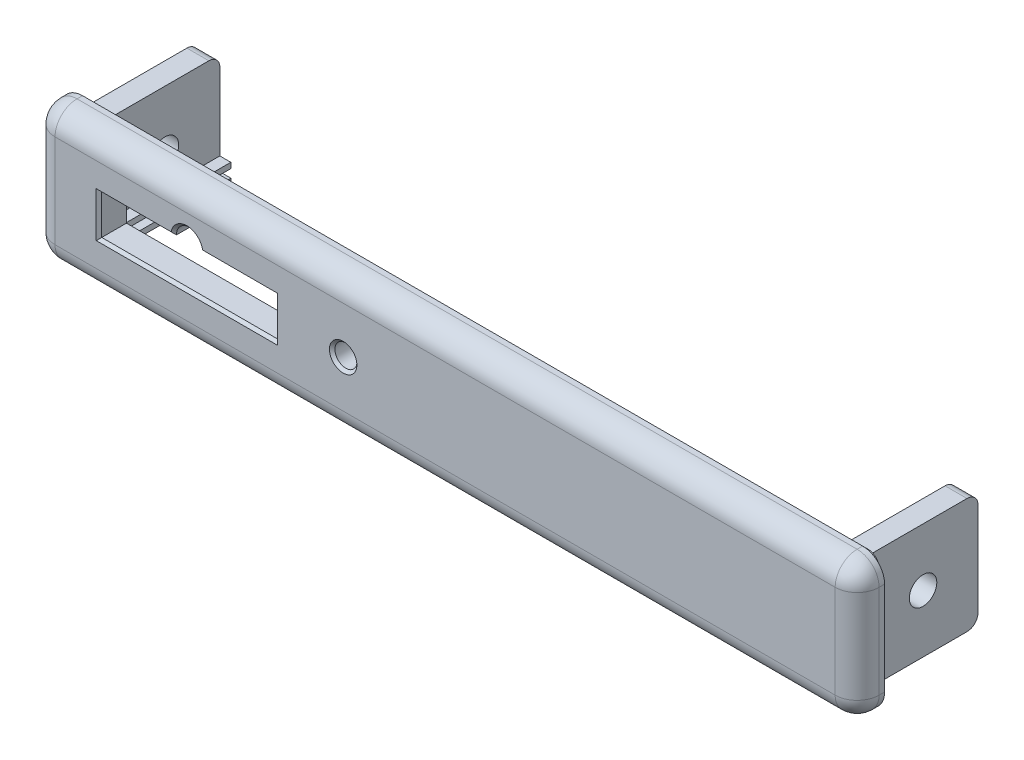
ISO-10303-21;
HEADER;
FILE_DESCRIPTION(('STEP AP214'),'2;1');
FILE_NAME('part.step','',(''),(''),'','','');
FILE_SCHEMA(('AUTOMOTIVE_DESIGN { 1 0 10303 214 1 1 1 1 }'));
ENDSEC;
DATA;
#1=APPLICATION_CONTEXT('core data for automotive mechanical design processes');
#2=APPLICATION_PROTOCOL_DEFINITION('international standard','automotive_design',2000,#1);
#3=PRODUCT_CONTEXT('',#1,'mechanical');
#4=PRODUCT('Part','Part','',(#3));
#5=PRODUCT_RELATED_PRODUCT_CATEGORY('part','',(#4));
#6=PRODUCT_DEFINITION_FORMATION('','',#4);
#7=PRODUCT_DEFINITION_CONTEXT('part definition',#1,'design');
#8=PRODUCT_DEFINITION('design','',#6,#7);
#9=PRODUCT_DEFINITION_SHAPE('','',#8);
#10=(LENGTH_UNIT() NAMED_UNIT(*) SI_UNIT(.MILLI.,.METRE.));
#11=(NAMED_UNIT(*) PLANE_ANGLE_UNIT() SI_UNIT($,.RADIAN.));
#12=(NAMED_UNIT(*) SI_UNIT($,.STERADIAN.) SOLID_ANGLE_UNIT());
#13=UNCERTAINTY_MEASURE_WITH_UNIT(LENGTH_MEASURE(1.E-05),#10,'distance_accuracy_value','');
#14=(GEOMETRIC_REPRESENTATION_CONTEXT(3) GLOBAL_UNCERTAINTY_ASSIGNED_CONTEXT((#13)) GLOBAL_UNIT_ASSIGNED_CONTEXT((#10,
#11,#12)) REPRESENTATION_CONTEXT('',''));
#15=CARTESIAN_POINT('',(0.,0.,0.));
#16=DIRECTION('',(0.,0.,1.));
#17=DIRECTION('',(1.,0.,0.));
#18=AXIS2_PLACEMENT_3D('',#15,#16,#17);
#19=CARTESIAN_POINT('',(-37.5,-10.,0.));
#20=DIRECTION('',(0.,0.,1.));
#21=DIRECTION('',(1.,0.,0.));
#22=AXIS2_PLACEMENT_3D('',#19,#20,#21);
#23=PLANE('',#22);
#24=DIRECTION('',(0.,-1.,0.));
#25=VECTOR('',#24,1.);
#26=CARTESIAN_POINT('',(-14.5,-1.05000000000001,0.));
#27=LINE('',#26,#25);
#28=CARTESIAN_POINT('',(-14.5,-1.05000000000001,0.));
#29=VERTEX_POINT('',#28);
#30=CARTESIAN_POINT('',(-14.5,-5.54999999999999,0.));
#31=VERTEX_POINT('',#30);
#32=EDGE_CURVE('E472',#29,#31,#27,.T.);
#33=ORIENTED_EDGE('',*,*,#32,.F.);
#34=CARTESIAN_POINT('',(-15.5,-1.05,0.));
#35=DIRECTION('',(0.,0.,-1.));
#36=DIRECTION('',(1.,0.,0.));
#37=AXIS2_PLACEMENT_3D('',#34,#35,#36);
#38=CIRCLE('',#37,1.);
#39=CARTESIAN_POINT('',(-15.5,-0.0499999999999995,0.));
#40=VERTEX_POINT('',#39);
#41=EDGE_CURVE('E52',#40,#29,#38,.T.);
#42=ORIENTED_EDGE('',*,*,#41,.F.);
#43=DIRECTION('',(1.,0.,0.));
#44=VECTOR('',#43,1.);
#45=CARTESIAN_POINT('',(-15.5,-0.0499999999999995,0.));
#46=LINE('',#45,#44);
#47=CARTESIAN_POINT('',(-31.5,-0.0499999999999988,0.));
#48=VERTEX_POINT('',#47);
#49=EDGE_CURVE('E452',#48,#40,#46,.T.);
#50=ORIENTED_EDGE('',*,*,#49,.F.);
#51=CARTESIAN_POINT('',(-31.5,-1.05,0.));
#52=DIRECTION('',(0.,0.,-1.));
#53=DIRECTION('',(1.,0.,0.));
#54=AXIS2_PLACEMENT_3D('',#51,#52,#53);
#55=CIRCLE('',#54,1.);
#56=CARTESIAN_POINT('',(-32.5,-1.05000000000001,0.));
#57=VERTEX_POINT('',#56);
#58=EDGE_CURVE('E455',#57,#48,#55,.T.);
#59=ORIENTED_EDGE('',*,*,#58,.F.);
#60=DIRECTION('',(0.,1.,0.));
#61=VECTOR('',#60,1.);
#62=CARTESIAN_POINT('',(-32.5,-1.05000000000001,0.));
#63=LINE('',#62,#61);
#64=CARTESIAN_POINT('',(-32.5,-5.54999999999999,0.));
#65=VERTEX_POINT('',#64);
#66=EDGE_CURVE('E483',#65,#57,#63,.T.);
#67=ORIENTED_EDGE('',*,*,#66,.F.);
#68=CARTESIAN_POINT('',(-31.5,-5.55,0.));
#69=DIRECTION('',(0.,0.,-1.));
#70=DIRECTION('',(1.,0.,0.));
#71=AXIS2_PLACEMENT_3D('',#68,#69,#70);
#72=CIRCLE('',#71,1.);
#73=CARTESIAN_POINT('',(-31.5,-6.55,0.));
#74=VERTEX_POINT('',#73);
#75=EDGE_CURVE('E480',#74,#65,#72,.T.);
#76=ORIENTED_EDGE('',*,*,#75,.F.);
#77=DIRECTION('',(-1.,0.,0.));
#78=VECTOR('',#77,1.);
#79=CARTESIAN_POINT('',(-15.5,-6.55,0.));
#80=LINE('',#79,#78);
#81=CARTESIAN_POINT('',(-15.5,-6.55,0.));
#82=VERTEX_POINT('',#81);
#83=EDGE_CURVE('E477',#82,#74,#80,.T.);
#84=ORIENTED_EDGE('',*,*,#83,.F.);
#85=CARTESIAN_POINT('',(-15.5,-5.55,0.));
#86=DIRECTION('',(0.,0.,-1.));
#87=DIRECTION('',(1.,0.,0.));
#88=AXIS2_PLACEMENT_3D('',#85,#86,#87);
#89=CIRCLE('',#88,1.);
#90=EDGE_CURVE('E474',#31,#82,#89,.T.);
#91=ORIENTED_EDGE('',*,*,#90,.F.);
#92=EDGE_LOOP('',(#33,#42,#50,#59,#67,#76,#84,#91));
#93=FACE_BOUND('',#92,.T.);
#94=CARTESIAN_POINT('',(-9.27781503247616,-3.75,0.));
#95=DIRECTION('',(0.,0.,1.));
#96=DIRECTION('',(1.,0.,0.));
#97=AXIS2_PLACEMENT_3D('',#94,#95,#96);
#98=CIRCLE('',#97,1.);
#99=CARTESIAN_POINT('',(-8.27781503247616,-3.75,0.));
#100=VERTEX_POINT('',#99);
#101=EDGE_CURVE('E597',#100,#100,#98,.T.);
#102=ORIENTED_EDGE('',*,*,#101,.T.);
#103=EDGE_LOOP('',(#102));
#104=FACE_BOUND('',#103,.T.);
#105=DIRECTION('',(0.,1.,0.));
#106=VECTOR('',#105,1.);
#107=CARTESIAN_POINT('',(-32.5,-1.00000000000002,0.));
#108=LINE('',#107,#106);
#109=CARTESIAN_POINT('',(-32.5,-7.,0.));
#110=VERTEX_POINT('',#109);
#111=CARTESIAN_POINT('',(-32.5,-6.5,0.));
#112=VERTEX_POINT('',#111);
#113=EDGE_CURVE('E621',#110,#112,#108,.T.);
#114=ORIENTED_EDGE('',*,*,#113,.T.);
#115=DIRECTION('',(1.,0.,0.));
#116=VECTOR('',#115,1.);
#117=CARTESIAN_POINT('',(33.5,-6.5,0.));
#118=LINE('',#117,#116);
#119=CARTESIAN_POINT('',(-33.5,-6.5,0.));
#120=VERTEX_POINT('',#119);
#121=EDGE_CURVE('E686',#120,#112,#118,.T.);
#122=ORIENTED_EDGE('',*,*,#121,.F.);
#123=DIRECTION('',(0.,1.,0.));
#124=VECTOR('',#123,1.);
#125=CARTESIAN_POINT('',(-33.5,1.5,0.));
#126=LINE('',#125,#124);
#127=CARTESIAN_POINT('',(-33.5,1.5,0.));
#128=VERTEX_POINT('',#127);
#129=EDGE_CURVE('E737',#120,#128,#126,.T.);
#130=ORIENTED_EDGE('',*,*,#129,.T.);
#131=DIRECTION('',(-1.,0.,0.));
#132=VECTOR('',#131,1.);
#133=CARTESIAN_POINT('',(-33.5,1.5,0.));
#134=LINE('',#133,#132);
#135=CARTESIAN_POINT('',(-35.5,1.5,0.));
#136=VERTEX_POINT('',#135);
#137=EDGE_CURVE('E744',#128,#136,#134,.T.);
#138=ORIENTED_EDGE('',*,*,#137,.T.);
#139=DIRECTION('',(0.,-1.,0.));
#140=VECTOR('',#139,1.);
#141=CARTESIAN_POINT('',(-35.5,9.36337869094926,0.));
#142=LINE('',#141,#140);
#143=CARTESIAN_POINT('',(-35.5,-9.,0.));
#144=VERTEX_POINT('',#143);
#145=EDGE_CURVE('E714',#136,#144,#142,.T.);
#146=ORIENTED_EDGE('',*,*,#145,.T.);
#147=DIRECTION('',(-1.,0.,0.));
#148=VECTOR('',#147,1.);
#149=CARTESIAN_POINT('',(-33.5,-9.,0.));
#150=LINE('',#149,#148);
#151=CARTESIAN_POINT('',(-33.5,-9.,0.));
#152=VERTEX_POINT('',#151);
#153=EDGE_CURVE('E745',#152,#144,#150,.T.);
#154=ORIENTED_EDGE('',*,*,#153,.F.);
#155=CARTESIAN_POINT('',(-33.5,-8.25,0.));
#156=VERTEX_POINT('',#155);
#157=EDGE_CURVE('E733',#152,#156,#126,.T.);
#158=ORIENTED_EDGE('',*,*,#157,.T.);
#159=DIRECTION('',(-1.,0.,0.));
#160=VECTOR('',#159,1.);
#161=CARTESIAN_POINT('',(33.5,-8.25,0.));
#162=LINE('',#161,#160);
#163=CARTESIAN_POINT('',(-32.5,-8.25,0.));
#164=VERTEX_POINT('',#163);
#165=EDGE_CURVE('E681',#164,#156,#162,.T.);
#166=ORIENTED_EDGE('',*,*,#165,.F.);
#167=CARTESIAN_POINT('',(-32.5,-7.75,0.));
#168=VERTEX_POINT('',#167);
#169=EDGE_CURVE('E620',#164,#168,#108,.T.);
#170=ORIENTED_EDGE('',*,*,#169,.T.);
#171=DIRECTION('',(-1.,0.,0.));
#172=VECTOR('',#171,1.);
#173=CARTESIAN_POINT('',(33.5,-7.75000000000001,0.));
#174=LINE('',#173,#172);
#175=CARTESIAN_POINT('',(-33.5,-7.75,0.));
#176=VERTEX_POINT('',#175);
#177=EDGE_CURVE('E643',#168,#176,#174,.T.);
#178=ORIENTED_EDGE('',*,*,#177,.T.);
#179=DIRECTION('',(0.,1.,0.));
#180=VECTOR('',#179,1.);
#181=CARTESIAN_POINT('',(-33.5,-7.00000000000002,0.));
#182=LINE('',#181,#180);
#183=CARTESIAN_POINT('',(-33.5,-7.,0.));
#184=VERTEX_POINT('',#183);
#185=EDGE_CURVE('E667',#176,#184,#182,.T.);
#186=ORIENTED_EDGE('',*,*,#185,.T.);
#187=DIRECTION('',(1.,0.,0.));
#188=VECTOR('',#187,1.);
#189=CARTESIAN_POINT('',(33.5,-7.00000000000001,0.));
#190=LINE('',#189,#188);
#191=EDGE_CURVE('E663',#184,#110,#190,.T.);
#192=ORIENTED_EDGE('',*,*,#191,.T.);
#193=EDGE_LOOP('',(#114,#122,#130,#138,#146,#154,#158,#166,#170,#178,#186,#192));
#194=FACE_BOUND('',#193,.T.);
#195=DIRECTION('',(0.,-1.,0.));
#196=VECTOR('',#195,1.);
#197=CARTESIAN_POINT('',(32.5,-2.25000000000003,0.));
#198=LINE('',#197,#196);
#199=CARTESIAN_POINT('',(32.5,-7.75000000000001,0.));
#200=VERTEX_POINT('',#199);
#201=CARTESIAN_POINT('',(32.5,-8.25,0.));
#202=VERTEX_POINT('',#201);
#203=EDGE_CURVE('E616',#200,#202,#198,.T.);
#204=ORIENTED_EDGE('',*,*,#203,.T.);
#205=CARTESIAN_POINT('',(33.5,-8.25,0.));
#206=VERTEX_POINT('',#205);
#207=EDGE_CURVE('E682',#206,#202,#162,.T.);
#208=ORIENTED_EDGE('',*,*,#207,.F.);
#209=DIRECTION('',(0.,-1.,0.));
#210=VECTOR('',#209,1.);
#211=CARTESIAN_POINT('',(33.5,1.5,0.));
#212=LINE('',#211,#210);
#213=CARTESIAN_POINT('',(33.5,-9.,0.));
#214=VERTEX_POINT('',#213);
#215=EDGE_CURVE('E748',#206,#214,#212,.T.);
#216=ORIENTED_EDGE('',*,*,#215,.T.);
#217=DIRECTION('',(1.,0.,0.));
#218=VECTOR('',#217,1.);
#219=CARTESIAN_POINT('',(33.5,-9.,0.));
#220=LINE('',#219,#218);
#221=CARTESIAN_POINT('',(35.5,-9.,0.));
#222=VERTEX_POINT('',#221);
#223=EDGE_CURVE('E762',#214,#222,#220,.T.);
#224=ORIENTED_EDGE('',*,*,#223,.T.);
#225=DIRECTION('',(0.,1.,0.));
#226=VECTOR('',#225,1.);
#227=CARTESIAN_POINT('',(35.5,3.,0.));
#228=LINE('',#227,#226);
#229=CARTESIAN_POINT('',(35.5,1.5,0.));
#230=VERTEX_POINT('',#229);
#231=EDGE_CURVE('E725',#222,#230,#228,.T.);
#232=ORIENTED_EDGE('',*,*,#231,.T.);
#233=DIRECTION('',(1.,0.,0.));
#234=VECTOR('',#233,1.);
#235=CARTESIAN_POINT('',(33.5,1.5,0.));
#236=LINE('',#235,#234);
#237=CARTESIAN_POINT('',(33.5,1.5,0.));
#238=VERTEX_POINT('',#237);
#239=EDGE_CURVE('E767',#238,#230,#236,.T.);
#240=ORIENTED_EDGE('',*,*,#239,.F.);
#241=CARTESIAN_POINT('',(33.5,-6.5,0.));
#242=VERTEX_POINT('',#241);
#243=EDGE_CURVE('E751',#238,#242,#212,.T.);
#244=ORIENTED_EDGE('',*,*,#243,.T.);
#245=CARTESIAN_POINT('',(32.5,-6.5,0.));
#246=VERTEX_POINT('',#245);
#247=EDGE_CURVE('E690',#246,#242,#118,.T.);
#248=ORIENTED_EDGE('',*,*,#247,.F.);
#249=CARTESIAN_POINT('',(32.5,-7.,0.));
#250=VERTEX_POINT('',#249);
#251=EDGE_CURVE('E619',#246,#250,#198,.T.);
#252=ORIENTED_EDGE('',*,*,#251,.T.);
#253=CARTESIAN_POINT('',(33.5,-7.00000000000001,0.));
#254=VERTEX_POINT('',#253);
#255=EDGE_CURVE('E666',#250,#254,#190,.T.);
#256=ORIENTED_EDGE('',*,*,#255,.T.);
#257=DIRECTION('',(0.,-1.,0.));
#258=VECTOR('',#257,1.);
#259=CARTESIAN_POINT('',(33.5,-7.00000000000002,0.));
#260=LINE('',#259,#258);
#261=CARTESIAN_POINT('',(33.5,-7.75000000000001,0.));
#262=VERTEX_POINT('',#261);
#263=EDGE_CURVE('E658',#254,#262,#260,.T.);
#264=ORIENTED_EDGE('',*,*,#263,.T.);
#265=EDGE_CURVE('E654',#262,#200,#174,.T.);
#266=ORIENTED_EDGE('',*,*,#265,.T.);
#267=EDGE_LOOP('',(#204,#208,#216,#224,#232,#240,#244,#248,#252,#256,#264,#266));
#268=FACE_BOUND('',#267,.T.);
#269=CARTESIAN_POINT('',(35.5,1.,0.));
#270=DIRECTION('',(0.,0.,-1.));
#271=DIRECTION('',(-1.,0.,0.));
#272=AXIS2_PLACEMENT_3D('',#269,#270,#271);
#273=CIRCLE('',#272,1.);
#274=CARTESIAN_POINT('',(35.5,2.,0.));
#275=VERTEX_POINT('',#274);
#276=CARTESIAN_POINT('',(36.5,1.,0.));
#277=VERTEX_POINT('',#276);
#278=EDGE_CURVE('E514',#275,#277,#273,.T.);
#279=ORIENTED_EDGE('',*,*,#278,.T.);
#280=DIRECTION('',(0.,-1.,0.));
#281=VECTOR('',#280,1.);
#282=CARTESIAN_POINT('',(36.5,1.,0.));
#283=LINE('',#282,#281);
#284=CARTESIAN_POINT('',(36.5,-8.5,0.));
#285=VERTEX_POINT('',#284);
#286=EDGE_CURVE('E543',#277,#285,#283,.T.);
#287=ORIENTED_EDGE('',*,*,#286,.T.);
#288=CARTESIAN_POINT('',(35.5,-8.5,0.));
#289=DIRECTION('',(0.,0.,-1.));
#290=DIRECTION('',(-1.,0.,0.));
#291=AXIS2_PLACEMENT_3D('',#288,#289,#290);
#292=CIRCLE('',#291,1.);
#293=CARTESIAN_POINT('',(35.5,-9.5,0.));
#294=VERTEX_POINT('',#293);
#295=EDGE_CURVE('E546',#285,#294,#292,.T.);
#296=ORIENTED_EDGE('',*,*,#295,.T.);
#297=DIRECTION('',(-1.,0.,0.));
#298=VECTOR('',#297,1.);
#299=CARTESIAN_POINT('',(35.5,-9.5,0.));
#300=LINE('',#299,#298);
#301=CARTESIAN_POINT('',(-35.5,-9.5,0.));
#302=VERTEX_POINT('',#301);
#303=EDGE_CURVE('E549',#294,#302,#300,.T.);
#304=ORIENTED_EDGE('',*,*,#303,.T.);
#305=CARTESIAN_POINT('',(-35.5,-8.5,0.));
#306=DIRECTION('',(0.,0.,-1.));
#307=DIRECTION('',(-1.,0.,0.));
#308=AXIS2_PLACEMENT_3D('',#305,#306,#307);
#309=CIRCLE('',#308,1.);
#310=CARTESIAN_POINT('',(-36.5,-8.5,0.));
#311=VERTEX_POINT('',#310);
#312=EDGE_CURVE('E552',#302,#311,#309,.T.);
#313=ORIENTED_EDGE('',*,*,#312,.T.);
#314=DIRECTION('',(0.,1.,0.));
#315=VECTOR('',#314,1.);
#316=CARTESIAN_POINT('',(-36.5,1.,0.));
#317=LINE('',#316,#315);
#318=CARTESIAN_POINT('',(-36.5,1.,0.));
#319=VERTEX_POINT('',#318);
#320=EDGE_CURVE('E555',#311,#319,#317,.T.);
#321=ORIENTED_EDGE('',*,*,#320,.T.);
#322=CARTESIAN_POINT('',(-35.5,1.,0.));
#323=DIRECTION('',(0.,0.,-1.));
#324=DIRECTION('',(1.,0.,0.));
#325=AXIS2_PLACEMENT_3D('',#322,#323,#324);
#326=CIRCLE('',#325,1.);
#327=CARTESIAN_POINT('',(-35.5,2.,0.));
#328=VERTEX_POINT('',#327);
#329=EDGE_CURVE('E558',#319,#328,#326,.T.);
#330=ORIENTED_EDGE('',*,*,#329,.T.);
#331=DIRECTION('',(1.,0.,0.));
#332=VECTOR('',#331,1.);
#333=CARTESIAN_POINT('',(35.5,2.,0.));
#334=LINE('',#333,#332);
#335=EDGE_CURVE('E519',#328,#275,#334,.T.);
#336=ORIENTED_EDGE('',*,*,#335,.T.);
#337=EDGE_LOOP('',(#279,#287,#296,#304,#313,#321,#330,#336));
#338=FACE_BOUND('',#337,.T.);
#339=ADVANCED_FACE('F37',(#93,#104,#194,#268,#338),#23,.F.);
#340=CARTESIAN_POINT('',(-37.5,2.5,3.));
#341=DIRECTION('',(1.,0.,0.));
#342=DIRECTION('',(0.,0.,-1.));
#343=AXIS2_PLACEMENT_3D('',#340,#341,#342);
#344=PLANE('',#343);
#345=DIRECTION('',(0.,1.,0.));
#346=VECTOR('',#345,1.);
#347=CARTESIAN_POINT('',(-37.5,2.5,0.5));
#348=LINE('',#347,#346);
#349=CARTESIAN_POINT('',(-37.5,-8.,0.5));
#350=VERTEX_POINT('',#349);
#351=CARTESIAN_POINT('',(-37.5,0.5,0.5));
#352=VERTEX_POINT('',#351);
#353=EDGE_CURVE('E581',#350,#352,#348,.T.);
#354=ORIENTED_EDGE('',*,*,#353,.F.);
#355=DIRECTION('',(0.,0.,-1.));
#356=VECTOR('',#355,1.);
#357=CARTESIAN_POINT('',(-37.5,-8.,3.));
#358=LINE('',#357,#356);
#359=CARTESIAN_POINT('',(-37.5,-8.,1.));
#360=VERTEX_POINT('',#359);
#361=EDGE_CURVE('E808',#350,#360,#358,.F.);
#362=ORIENTED_EDGE('',*,*,#361,.T.);
#363=DIRECTION('',(0.,-1.,0.));
#364=VECTOR('',#363,1.);
#365=CARTESIAN_POINT('',(-37.5,2.5,1.));
#366=LINE('',#365,#364);
#367=CARTESIAN_POINT('',(-37.5,0.5,1.));
#368=VERTEX_POINT('',#367);
#369=EDGE_CURVE('E806',#360,#368,#366,.F.);
#370=ORIENTED_EDGE('',*,*,#369,.T.);
#371=DIRECTION('',(0.,0.,-1.));
#372=VECTOR('',#371,1.);
#373=CARTESIAN_POINT('',(-37.5,0.5,3.));
#374=LINE('',#373,#372);
#375=EDGE_CURVE('E803',#368,#352,#374,.T.);
#376=ORIENTED_EDGE('',*,*,#375,.T.);
#377=EDGE_LOOP('',(#354,#362,#370,#376));
#378=FACE_BOUND('',#377,.T.);
#379=ADVANCED_FACE('F976',(#378),#344,.F.);
#380=CARTESIAN_POINT('',(-37.5,-10.,3.));
#381=DIRECTION('',(0.,1.,0.));
#382=DIRECTION('',(0.,0.,1.));
#383=AXIS2_PLACEMENT_3D('',#380,#381,#382);
#384=PLANE('',#383);
#385=DIRECTION('',(-1.,0.,0.));
#386=VECTOR('',#385,1.);
#387=CARTESIAN_POINT('',(-37.5,-10.,0.5));
#388=LINE('',#387,#386);
#389=CARTESIAN_POINT('',(35.5,-10.,0.5));
#390=VERTEX_POINT('',#389);
#391=CARTESIAN_POINT('',(-35.5,-10.,0.5));
#392=VERTEX_POINT('',#391);
#393=EDGE_CURVE('E591',#390,#392,#388,.T.);
#394=ORIENTED_EDGE('',*,*,#393,.F.);
#395=DIRECTION('',(0.,0.,-1.));
#396=VECTOR('',#395,1.);
#397=CARTESIAN_POINT('',(35.5,-10.,3.));
#398=LINE('',#397,#396);
#399=CARTESIAN_POINT('',(35.5,-10.,1.));
#400=VERTEX_POINT('',#399);
#401=EDGE_CURVE('E796',#390,#400,#398,.F.);
#402=ORIENTED_EDGE('',*,*,#401,.T.);
#403=DIRECTION('',(1.,0.,0.));
#404=VECTOR('',#403,1.);
#405=CARTESIAN_POINT('',(-37.5,-10.,1.));
#406=LINE('',#405,#404);
#407=CARTESIAN_POINT('',(-35.5,-10.,1.));
#408=VERTEX_POINT('',#407);
#409=EDGE_CURVE('E798',#400,#408,#406,.F.);
#410=ORIENTED_EDGE('',*,*,#409,.T.);
#411=DIRECTION('',(0.,0.,-1.));
#412=VECTOR('',#411,1.);
#413=CARTESIAN_POINT('',(-35.5,-10.,3.));
#414=LINE('',#413,#412);
#415=EDGE_CURVE('E800',#408,#392,#414,.T.);
#416=ORIENTED_EDGE('',*,*,#415,.T.);
#417=EDGE_LOOP('',(#394,#402,#410,#416));
#418=FACE_BOUND('',#417,.T.);
#419=ADVANCED_FACE('F982',(#418),#384,.F.);
#420=CARTESIAN_POINT('',(37.5,2.5,3.));
#421=DIRECTION('',(-1.,0.,0.));
#422=DIRECTION('',(0.,0.,1.));
#423=AXIS2_PLACEMENT_3D('',#420,#421,#422);
#424=PLANE('',#423);
#425=DIRECTION('',(0.,-1.,0.));
#426=VECTOR('',#425,1.);
#427=CARTESIAN_POINT('',(37.5,2.5,0.5));
#428=LINE('',#427,#426);
#429=CARTESIAN_POINT('',(37.5,0.5,0.5));
#430=VERTEX_POINT('',#429);
#431=CARTESIAN_POINT('',(37.5,-8.,0.5));
#432=VERTEX_POINT('',#431);
#433=EDGE_CURVE('E589',#430,#432,#428,.T.);
#434=ORIENTED_EDGE('',*,*,#433,.F.);
#435=DIRECTION('',(0.,0.,-1.));
#436=VECTOR('',#435,1.);
#437=CARTESIAN_POINT('',(37.5,0.5,3.));
#438=LINE('',#437,#436);
#439=CARTESIAN_POINT('',(37.5,0.5,1.));
#440=VERTEX_POINT('',#439);
#441=EDGE_CURVE('E789',#430,#440,#438,.F.);
#442=ORIENTED_EDGE('',*,*,#441,.T.);
#443=DIRECTION('',(0.,1.,0.));
#444=VECTOR('',#443,1.);
#445=CARTESIAN_POINT('',(37.5,-10.,1.));
#446=LINE('',#445,#444);
#447=CARTESIAN_POINT('',(37.5,-8.,1.));
#448=VERTEX_POINT('',#447);
#449=EDGE_CURVE('E791',#440,#448,#446,.F.);
#450=ORIENTED_EDGE('',*,*,#449,.T.);
#451=DIRECTION('',(0.,0.,-1.));
#452=VECTOR('',#451,1.);
#453=CARTESIAN_POINT('',(37.5,-8.,3.));
#454=LINE('',#453,#452);
#455=EDGE_CURVE('E793',#448,#432,#454,.T.);
#456=ORIENTED_EDGE('',*,*,#455,.T.);
#457=EDGE_LOOP('',(#434,#442,#450,#456));
#458=FACE_BOUND('',#457,.T.);
#459=ADVANCED_FACE('F1056',(#458),#424,.F.);
#460=CARTESIAN_POINT('',(-37.5,2.5,3.));
#461=DIRECTION('',(0.,-1.,0.));
#462=DIRECTION('',(0.,0.,-1.));
#463=AXIS2_PLACEMENT_3D('',#460,#461,#462);
#464=PLANE('',#463);
#465=DIRECTION('',(1.,0.,0.));
#466=VECTOR('',#465,1.);
#467=CARTESIAN_POINT('',(-37.5,2.5,0.5));
#468=LINE('',#467,#466);
#469=CARTESIAN_POINT('',(-35.5,2.5,0.5));
#470=VERTEX_POINT('',#469);
#471=CARTESIAN_POINT('',(35.5,2.5,0.5));
#472=VERTEX_POINT('',#471);
#473=EDGE_CURVE('E565',#470,#472,#468,.T.);
#474=ORIENTED_EDGE('',*,*,#473,.F.);
#475=DIRECTION('',(0.,0.,-1.));
#476=VECTOR('',#475,1.);
#477=CARTESIAN_POINT('',(-35.5,2.5,3.));
#478=LINE('',#477,#476);
#479=CARTESIAN_POINT('',(-35.5,2.5,1.));
#480=VERTEX_POINT('',#479);
#481=EDGE_CURVE('E787',#470,#480,#478,.F.);
#482=ORIENTED_EDGE('',*,*,#481,.T.);
#483=DIRECTION('',(-1.,0.,0.));
#484=VECTOR('',#483,1.);
#485=CARTESIAN_POINT('',(37.5,2.5,1.));
#486=LINE('',#485,#484);
#487=CARTESIAN_POINT('',(35.5,2.5,1.));
#488=VERTEX_POINT('',#487);
#489=EDGE_CURVE('E784',#480,#488,#486,.F.);
#490=ORIENTED_EDGE('',*,*,#489,.T.);
#491=DIRECTION('',(0.,0.,-1.));
#492=VECTOR('',#491,1.);
#493=CARTESIAN_POINT('',(35.5,2.5,3.));
#494=LINE('',#493,#492);
#495=EDGE_CURVE('E781',#488,#472,#494,.T.);
#496=ORIENTED_EDGE('',*,*,#495,.T.);
#497=EDGE_LOOP('',(#474,#482,#490,#496));
#498=FACE_BOUND('',#497,.T.);
#499=ADVANCED_FACE('F1052',(#498),#464,.F.);
#500=CARTESIAN_POINT('',(35.5,-8.,3.));
#501=DIRECTION('',(0.,0.,-1.));
#502=DIRECTION('',(-1.,0.,0.));
#503=AXIS2_PLACEMENT_3D('',#500,#501,#502);
#504=CYLINDRICAL_SURFACE('',#503,2.);
#505=ORIENTED_EDGE('',*,*,#401,.F.);
#506=CARTESIAN_POINT('',(35.5,-8.,0.5));
#507=DIRECTION('',(0.,0.,-1.));
#508=DIRECTION('',(-1.,0.,0.));
#509=AXIS2_PLACEMENT_3D('',#506,#507,#508);
#510=CIRCLE('',#509,2.);
#511=EDGE_CURVE('E593',#390,#432,#510,.F.);
#512=ORIENTED_EDGE('',*,*,#511,.T.);
#513=ORIENTED_EDGE('',*,*,#455,.F.);
#514=CARTESIAN_POINT('',(35.5,-8.,1.));
#515=DIRECTION('',(0.,0.,1.));
#516=DIRECTION('',(1.,0.,0.));
#517=AXIS2_PLACEMENT_3D('',#514,#515,#516);
#518=CIRCLE('',#517,2.);
#519=EDGE_CURVE('E841',#400,#448,#518,.T.);
#520=ORIENTED_EDGE('',*,*,#519,.F.);
#521=EDGE_LOOP('',(#505,#512,#513,#520));
#522=FACE_BOUND('',#521,.T.);
#523=ADVANCED_FACE('F1055',(#522),#504,.T.);
#524=CARTESIAN_POINT('',(-35.5,-8.,3.));
#525=DIRECTION('',(0.,0.,-1.));
#526=DIRECTION('',(-1.,0.,0.));
#527=AXIS2_PLACEMENT_3D('',#524,#525,#526);
#528=CYLINDRICAL_SURFACE('',#527,2.);
#529=ORIENTED_EDGE('',*,*,#361,.F.);
#530=CARTESIAN_POINT('',(-35.5,-8.,0.5));
#531=DIRECTION('',(0.,0.,-1.));
#532=DIRECTION('',(-1.,0.,0.));
#533=AXIS2_PLACEMENT_3D('',#530,#531,#532);
#534=CIRCLE('',#533,2.);
#535=EDGE_CURVE('E586',#350,#392,#534,.F.);
#536=ORIENTED_EDGE('',*,*,#535,.T.);
#537=ORIENTED_EDGE('',*,*,#415,.F.);
#538=CARTESIAN_POINT('',(-35.5,-8.,1.));
#539=DIRECTION('',(0.,0.,1.));
#540=DIRECTION('',(1.,0.,0.));
#541=AXIS2_PLACEMENT_3D('',#538,#539,#540);
#542=CIRCLE('',#541,2.);
#543=EDGE_CURVE('E832',#360,#408,#542,.T.);
#544=ORIENTED_EDGE('',*,*,#543,.F.);
#545=EDGE_LOOP('',(#529,#536,#537,#544));
#546=FACE_BOUND('',#545,.T.);
#547=ADVANCED_FACE('F1090',(#546),#528,.T.);
#548=CARTESIAN_POINT('',(35.5,0.5,3.));
#549=DIRECTION('',(0.,0.,-1.));
#550=DIRECTION('',(-1.,0.,0.));
#551=AXIS2_PLACEMENT_3D('',#548,#549,#550);
#552=CYLINDRICAL_SURFACE('',#551,2.);
#553=ORIENTED_EDGE('',*,*,#441,.F.);
#554=CARTESIAN_POINT('',(35.5,0.5,0.5));
#555=DIRECTION('',(0.,0.,-1.));
#556=DIRECTION('',(-1.,0.,0.));
#557=AXIS2_PLACEMENT_3D('',#554,#555,#556);
#558=CIRCLE('',#557,2.);
#559=EDGE_CURVE('E583',#430,#472,#558,.F.);
#560=ORIENTED_EDGE('',*,*,#559,.T.);
#561=ORIENTED_EDGE('',*,*,#495,.F.);
#562=CARTESIAN_POINT('',(35.5,0.5,1.));
#563=DIRECTION('',(0.,0.,1.));
#564=DIRECTION('',(1.,0.,0.));
#565=AXIS2_PLACEMENT_3D('',#562,#563,#564);
#566=CIRCLE('',#565,2.);
#567=EDGE_CURVE('E823',#440,#488,#566,.T.);
#568=ORIENTED_EDGE('',*,*,#567,.F.);
#569=EDGE_LOOP('',(#553,#560,#561,#568));
#570=FACE_BOUND('',#569,.T.);
#571=ADVANCED_FACE('F1078',(#570),#552,.T.);
#572=CARTESIAN_POINT('',(-35.5,0.5,3.));
#573=DIRECTION('',(0.,0.,-1.));
#574=DIRECTION('',(-1.,0.,0.));
#575=AXIS2_PLACEMENT_3D('',#572,#573,#574);
#576=CYLINDRICAL_SURFACE('',#575,2.);
#577=ORIENTED_EDGE('',*,*,#481,.F.);
#578=CARTESIAN_POINT('',(-35.5,0.5,0.5));
#579=DIRECTION('',(0.,0.,-1.));
#580=DIRECTION('',(-1.,0.,0.));
#581=AXIS2_PLACEMENT_3D('',#578,#579,#580);
#582=CIRCLE('',#581,2.);
#583=EDGE_CURVE('E45',#470,#352,#582,.F.);
#584=ORIENTED_EDGE('',*,*,#583,.T.);
#585=ORIENTED_EDGE('',*,*,#375,.F.);
#586=CARTESIAN_POINT('',(-35.5,0.5,1.));
#587=DIRECTION('',(0.,0.,1.));
#588=DIRECTION('',(1.,0.,0.));
#589=AXIS2_PLACEMENT_3D('',#586,#587,#588);
#590=CIRCLE('',#589,2.);
#591=EDGE_CURVE('E814',#480,#368,#590,.T.);
#592=ORIENTED_EDGE('',*,*,#591,.F.);
#593=EDGE_LOOP('',(#577,#584,#585,#592));
#594=FACE_BOUND('',#593,.T.);
#595=ADVANCED_FACE('F1050',(#594),#576,.T.);
#596=CARTESIAN_POINT('',(-37.5,-10.,3.));
#597=DIRECTION('',(0.,0.,1.));
#598=DIRECTION('',(1.,0.,0.));
#599=AXIS2_PLACEMENT_3D('',#596,#597,#598);
#600=PLANE('',#599);
#601=DIRECTION('',(1.,0.,0.));
#602=VECTOR('',#601,1.);
#603=CARTESIAN_POINT('',(-24.7,-1.69999999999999,3.));
#604=LINE('',#603,#602);
#605=CARTESIAN_POINT('',(-31.75,-1.69999999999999,3.));
#606=VERTEX_POINT('',#605);
#607=CARTESIAN_POINT('',(-24.9282856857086,-1.69999999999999,3.));
#608=VERTEX_POINT('',#607);
#609=EDGE_CURVE('E914',#606,#608,#604,.T.);
#610=ORIENTED_EDGE('',*,*,#609,.T.);
#611=CARTESIAN_POINT('',(-23.5,-1.95,3.));
#612=DIRECTION('',(0.,0.,1.));
#613=DIRECTION('',(1.,0.,0.));
#614=AXIS2_PLACEMENT_3D('',#611,#612,#613);
#615=CIRCLE('',#614,1.45);
#616=CARTESIAN_POINT('',(-22.0717143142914,-1.69999999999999,3.));
#617=VERTEX_POINT('',#616);
#618=EDGE_CURVE('E916',#608,#617,#615,.F.);
#619=ORIENTED_EDGE('',*,*,#618,.T.);
#620=DIRECTION('',(1.,0.,0.));
#621=VECTOR('',#620,1.);
#622=CARTESIAN_POINT('',(-15.5,-1.69999999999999,3.));
#623=LINE('',#622,#621);
#624=CARTESIAN_POINT('',(-15.25,-1.69999999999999,3.));
#625=VERTEX_POINT('',#624);
#626=EDGE_CURVE('E906',#617,#625,#623,.T.);
#627=ORIENTED_EDGE('',*,*,#626,.T.);
#628=DIRECTION('',(0.,-1.,0.));
#629=VECTOR('',#628,1.);
#630=CARTESIAN_POINT('',(-15.25,-5.55,3.));
#631=LINE('',#630,#629);
#632=CARTESIAN_POINT('',(-15.25,-5.8,3.));
#633=VERTEX_POINT('',#632);
#634=EDGE_CURVE('E908',#625,#633,#631,.T.);
#635=ORIENTED_EDGE('',*,*,#634,.T.);
#636=DIRECTION('',(-1.,0.,0.));
#637=VECTOR('',#636,1.);
#638=CARTESIAN_POINT('',(-31.5,-5.80000000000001,3.));
#639=LINE('',#638,#637);
#640=CARTESIAN_POINT('',(-31.75,-5.80000000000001,3.));
#641=VERTEX_POINT('',#640);
#642=EDGE_CURVE('E910',#633,#641,#639,.T.);
#643=ORIENTED_EDGE('',*,*,#642,.T.);
#644=DIRECTION('',(0.,1.,0.));
#645=VECTOR('',#644,1.);
#646=CARTESIAN_POINT('',(-31.75,-1.95,3.));
#647=LINE('',#646,#645);
#648=EDGE_CURVE('E912',#641,#606,#647,.T.);
#649=ORIENTED_EDGE('',*,*,#648,.T.);
#650=EDGE_LOOP('',(#610,#619,#627,#635,#643,#649));
#651=FACE_BOUND('',#650,.T.);
#652=DIRECTION('',(0.,1.,0.));
#653=VECTOR('',#652,1.);
#654=CARTESIAN_POINT('',(35.5,2.5,3.));
#655=LINE('',#654,#653);
#656=CARTESIAN_POINT('',(35.5,-8.,3.));
#657=VERTEX_POINT('',#656);
#658=CARTESIAN_POINT('',(35.5,0.5,3.));
#659=VERTEX_POINT('',#658);
#660=EDGE_CURVE('E776',#657,#659,#655,.T.);
#661=ORIENTED_EDGE('',*,*,#660,.T.);
#662=DIRECTION('',(-1.,0.,0.));
#663=VECTOR('',#662,1.);
#664=CARTESIAN_POINT('',(-37.5,0.5,3.));
#665=LINE('',#664,#663);
#666=CARTESIAN_POINT('',(-35.5,0.5,3.));
#667=VERTEX_POINT('',#666);
#668=EDGE_CURVE('E778',#659,#667,#665,.T.);
#669=ORIENTED_EDGE('',*,*,#668,.T.);
#670=DIRECTION('',(0.,-1.,0.));
#671=VECTOR('',#670,1.);
#672=CARTESIAN_POINT('',(-35.5,-10.,3.));
#673=LINE('',#672,#671);
#674=CARTESIAN_POINT('',(-35.5,-8.,3.));
#675=VERTEX_POINT('',#674);
#676=EDGE_CURVE('E770',#667,#675,#673,.T.);
#677=ORIENTED_EDGE('',*,*,#676,.T.);
#678=DIRECTION('',(1.,0.,0.));
#679=VECTOR('',#678,1.);
#680=CARTESIAN_POINT('',(37.5,-8.,3.));
#681=LINE('',#680,#679);
#682=EDGE_CURVE('E774',#675,#657,#681,.T.);
#683=ORIENTED_EDGE('',*,*,#682,.T.);
#684=EDGE_LOOP('',(#661,#669,#677,#683));
#685=FACE_BOUND('',#684,.T.);
#686=CARTESIAN_POINT('',(-9.27781503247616,-3.75,3.));
#687=DIRECTION('',(0.,0.,1.));
#688=DIRECTION('',(1.,0.,0.));
#689=AXIS2_PLACEMENT_3D('',#686,#687,#688);
#690=CIRCLE('',#689,1.25);
#691=CARTESIAN_POINT('',(-8.02781503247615,-3.75,3.));
#692=VERTEX_POINT('',#691);
#693=EDGE_CURVE('E898',#692,#692,#690,.F.);
#694=ORIENTED_EDGE('',*,*,#693,.T.);
#695=EDGE_LOOP('',(#694));
#696=FACE_BOUND('',#695,.T.);
#697=ADVANCED_FACE('F1046',(#651,#685,#696),#600,.T.);
#698=CARTESIAN_POINT('',(-31.5,-1.95,-10.));
#699=DIRECTION('',(0.,1.,0.));
#700=DIRECTION('',(0.,0.,1.));
#701=AXIS2_PLACEMENT_3D('',#698,#699,#700);
#702=PLANE('',#701);
#703=DIRECTION('',(0.,0.,-1.));
#704=VECTOR('',#703,1.);
#705=CARTESIAN_POINT('',(-22.3,-1.95,115.672329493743));
#706=LINE('',#705,#704);
#707=CARTESIAN_POINT('',(-22.3,-1.95,0.5));
#708=VERTEX_POINT('',#707);
#709=CARTESIAN_POINT('',(-22.3,-1.95,2.74999999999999));
#710=VERTEX_POINT('',#709);
#711=EDGE_CURVE('E904',#708,#710,#706,.F.);
#712=ORIENTED_EDGE('',*,*,#711,.F.);
#713=DIRECTION('',(1.,0.,0.));
#714=VECTOR('',#713,1.);
#715=CARTESIAN_POINT('',(-31.5,-1.95,0.5));
#716=LINE('',#715,#714);
#717=CARTESIAN_POINT('',(-15.5,-1.95,0.5));
#718=VERTEX_POINT('',#717);
#719=EDGE_CURVE('E59',#708,#718,#716,.T.);
#720=ORIENTED_EDGE('',*,*,#719,.T.);
#721=DIRECTION('',(0.,0.,1.));
#722=VECTOR('',#721,1.);
#723=CARTESIAN_POINT('',(-15.5,-1.95,-10.));
#724=LINE('',#723,#722);
#725=CARTESIAN_POINT('',(-15.5,-1.95,2.74999999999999));
#726=VERTEX_POINT('',#725);
#727=EDGE_CURVE('E605',#718,#726,#724,.T.);
#728=ORIENTED_EDGE('',*,*,#727,.T.);
#729=DIRECTION('',(-1.,0.,0.));
#730=VECTOR('',#729,1.);
#731=CARTESIAN_POINT('',(-22.3,-1.95,2.74999999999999));
#732=LINE('',#731,#730);
#733=EDGE_CURVE('E934',#726,#710,#732,.T.);
#734=ORIENTED_EDGE('',*,*,#733,.T.);
#735=EDGE_LOOP('',(#712,#720,#728,#734));
#736=FACE_BOUND('',#735,.T.);
#737=ADVANCED_FACE('F1049',(#736),#702,.F.);
#738=DIRECTION('',(0.,0.,1.));
#739=VECTOR('',#738,1.);
#740=CARTESIAN_POINT('',(-31.5,-1.95,-10.));
#741=LINE('',#740,#739);
#742=CARTESIAN_POINT('',(-31.5,-1.95,0.5));
#743=VERTEX_POINT('',#742);
#744=CARTESIAN_POINT('',(-31.5,-1.95,2.74999999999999));
#745=VERTEX_POINT('',#744);
#746=EDGE_CURVE('E602',#743,#745,#741,.T.);
#747=ORIENTED_EDGE('',*,*,#746,.F.);
#748=DIRECTION('',(1.,0.,0.));
#749=VECTOR('',#748,1.);
#750=CARTESIAN_POINT('',(-31.5,-1.95,0.5));
#751=LINE('',#750,#749);
#752=CARTESIAN_POINT('',(-24.7,-1.95,0.5));
#753=VERTEX_POINT('',#752);
#754=EDGE_CURVE('E490',#743,#753,#751,.T.);
#755=ORIENTED_EDGE('',*,*,#754,.T.);
#756=DIRECTION('',(0.,0.,-1.));
#757=VECTOR('',#756,1.);
#758=CARTESIAN_POINT('',(-24.7,-1.95,115.672329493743));
#759=LINE('',#758,#757);
#760=CARTESIAN_POINT('',(-24.7,-1.95,2.74999999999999));
#761=VERTEX_POINT('',#760);
#762=EDGE_CURVE('E901',#761,#753,#759,.T.);
#763=ORIENTED_EDGE('',*,*,#762,.F.);
#764=DIRECTION('',(-1.,0.,0.));
#765=VECTOR('',#764,1.);
#766=CARTESIAN_POINT('',(-31.5,-1.95,2.74999999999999));
#767=LINE('',#766,#765);
#768=EDGE_CURVE('E922',#761,#745,#767,.T.);
#769=ORIENTED_EDGE('',*,*,#768,.T.);
#770=EDGE_LOOP('',(#747,#755,#763,#769));
#771=FACE_BOUND('',#770,.T.);
#772=ADVANCED_FACE('F1190',(#771),#702,.F.);
#773=CARTESIAN_POINT('',(33.5,1.5,-10.));
#774=DIRECTION('',(0.,0.,-1.));
#775=DIRECTION('',(0.,1.,0.));
#776=AXIS2_PLACEMENT_3D('',#773,#774,#775);
#777=PLANE('',#776);
#778=DIRECTION('',(0.,1.,0.));
#779=VECTOR('',#778,1.);
#780=CARTESIAN_POINT('',(-32.5,-1.00000000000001,-10.));
#781=LINE('',#780,#779);
#782=CARTESIAN_POINT('',(-32.5,-8.,-10.));
#783=VERTEX_POINT('',#782);
#784=CARTESIAN_POINT('',(-32.5,-7.75,-10.));
#785=VERTEX_POINT('',#784);
#786=EDGE_CURVE('E612',#783,#785,#781,.T.);
#787=ORIENTED_EDGE('',*,*,#786,.F.);
#788=DIRECTION('',(-1.,0.,0.));
#789=VECTOR('',#788,1.);
#790=CARTESIAN_POINT('',(33.5,-8.,-10.));
#791=LINE('',#790,#789);
#792=CARTESIAN_POINT('',(-35.5,-8.,-10.));
#793=VERTEX_POINT('',#792);
#794=EDGE_CURVE('E882',#783,#793,#791,.T.);
#795=ORIENTED_EDGE('',*,*,#794,.T.);
#796=DIRECTION('',(0.,-1.,0.));
#797=VECTOR('',#796,1.);
#798=CARTESIAN_POINT('',(-35.5,9.36337869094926,-10.));
#799=LINE('',#798,#797);
#800=CARTESIAN_POINT('',(-35.5,0.499999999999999,-10.));
#801=VERTEX_POINT('',#800);
#802=EDGE_CURVE('E711',#801,#793,#799,.T.);
#803=ORIENTED_EDGE('',*,*,#802,.F.);
#804=DIRECTION('',(-1.,0.,0.));
#805=VECTOR('',#804,1.);
#806=CARTESIAN_POINT('',(33.5,0.5,-10.));
#807=LINE('',#806,#805);
#808=CARTESIAN_POINT('',(-33.5,0.5,-10.));
#809=VERTEX_POINT('',#808);
#810=EDGE_CURVE('E878',#801,#809,#807,.F.);
#811=ORIENTED_EDGE('',*,*,#810,.T.);
#812=DIRECTION('',(0.,-1.,0.));
#813=VECTOR('',#812,1.);
#814=CARTESIAN_POINT('',(-33.5,1.5,-10.));
#815=LINE('',#814,#813);
#816=CARTESIAN_POINT('',(-33.5,-6.5,-10.));
#817=VERTEX_POINT('',#816);
#818=EDGE_CURVE('E740',#809,#817,#815,.T.);
#819=ORIENTED_EDGE('',*,*,#818,.T.);
#820=DIRECTION('',(1.,0.,0.));
#821=VECTOR('',#820,1.);
#822=CARTESIAN_POINT('',(33.5,-6.5,-10.));
#823=LINE('',#822,#821);
#824=CARTESIAN_POINT('',(-32.5,-6.5,-10.));
#825=VERTEX_POINT('',#824);
#826=EDGE_CURVE('E678',#817,#825,#823,.T.);
#827=ORIENTED_EDGE('',*,*,#826,.T.);
#828=CARTESIAN_POINT('',(-32.5,-7.,-10.));
#829=VERTEX_POINT('',#828);
#830=EDGE_CURVE('E610',#829,#825,#781,.T.);
#831=ORIENTED_EDGE('',*,*,#830,.F.);
#832=DIRECTION('',(1.,0.,0.));
#833=VECTOR('',#832,1.);
#834=CARTESIAN_POINT('',(33.5,-7.,-10.));
#835=LINE('',#834,#833);
#836=CARTESIAN_POINT('',(-33.5,-7.,-10.));
#837=VERTEX_POINT('',#836);
#838=EDGE_CURVE('E640',#837,#829,#835,.T.);
#839=ORIENTED_EDGE('',*,*,#838,.F.);
#840=DIRECTION('',(0.,1.,0.));
#841=VECTOR('',#840,1.);
#842=CARTESIAN_POINT('',(-33.5,-7.,-10.));
#843=LINE('',#842,#841);
#844=CARTESIAN_POINT('',(-33.5,-7.75,-10.));
#845=VERTEX_POINT('',#844);
#846=EDGE_CURVE('E645',#845,#837,#843,.T.);
#847=ORIENTED_EDGE('',*,*,#846,.F.);
#848=DIRECTION('',(-1.,0.,0.));
#849=VECTOR('',#848,1.);
#850=CARTESIAN_POINT('',(33.5,-7.75,-10.));
#851=LINE('',#850,#849);
#852=EDGE_CURVE('E651',#785,#845,#851,.T.);
#853=ORIENTED_EDGE('',*,*,#852,.F.);
#854=EDGE_LOOP('',(#787,#795,#803,#811,#819,#827,#831,#839,#847,#853));
#855=FACE_BOUND('',#854,.T.);
#856=ADVANCED_FACE('F1042',(#855),#777,.T.);
#857=CARTESIAN_POINT('',(33.5,-8.25000000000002,67.0228505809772));
#858=DIRECTION('',(0.,-1.,0.));
#859=DIRECTION('',(0.,0.,-1.));
#860=AXIS2_PLACEMENT_3D('',#857,#858,#859);
#861=PLANE('',#860);
#862=DIRECTION('',(0.,0.,-1.));
#863=VECTOR('',#862,1.);
#864=CARTESIAN_POINT('',(-33.5,-8.25000000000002,67.0228505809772));
#865=LINE('',#864,#863);
#866=CARTESIAN_POINT('',(-33.5,-8.25,-9.96824583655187));
#867=VERTEX_POINT('',#866);
#868=EDGE_CURVE('E685',#156,#867,#865,.T.);
#869=ORIENTED_EDGE('',*,*,#868,.T.);
#870=DIRECTION('',(-1.,0.,0.));
#871=VECTOR('',#870,1.);
#872=CARTESIAN_POINT('',(-33.5,-8.25,-9.96824583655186));
#873=LINE('',#872,#871);
#874=CARTESIAN_POINT('',(-32.5,-8.25,-9.96824583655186));
#875=VERTEX_POINT('',#874);
#876=EDGE_CURVE('E891',#867,#875,#873,.F.);
#877=ORIENTED_EDGE('',*,*,#876,.T.);
#878=DIRECTION('',(0.,0.,-1.));
#879=VECTOR('',#878,1.);
#880=CARTESIAN_POINT('',(-32.5,-8.25000000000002,67.0228505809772));
#881=LINE('',#880,#879);
#882=EDGE_CURVE('E636',#164,#875,#881,.T.);
#883=ORIENTED_EDGE('',*,*,#882,.F.);
#884=ORIENTED_EDGE('',*,*,#165,.T.);
#885=EDGE_LOOP('',(#869,#877,#883,#884));
#886=FACE_BOUND('',#885,.T.);
#887=ADVANCED_FACE('F1000',(#886),#861,.T.);
#888=CARTESIAN_POINT('',(33.5,-6.50000000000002,67.0228505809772));
#889=DIRECTION('',(0.,1.,0.));
#890=DIRECTION('',(0.,0.,1.));
#891=AXIS2_PLACEMENT_3D('',#888,#889,#890);
#892=PLANE('',#891);
#893=DIRECTION('',(0.,0.,1.));
#894=VECTOR('',#893,1.);
#895=CARTESIAN_POINT('',(-32.5,-6.50000000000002,67.0228505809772));
#896=LINE('',#895,#894);
#897=EDGE_CURVE('E634',#825,#112,#896,.T.);
#898=ORIENTED_EDGE('',*,*,#897,.F.);
#899=ORIENTED_EDGE('',*,*,#826,.F.);
#900=DIRECTION('',(0.,0.,-1.));
#901=VECTOR('',#900,1.);
#902=CARTESIAN_POINT('',(-33.5,-6.50000000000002,67.0228505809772));
#903=LINE('',#902,#901);
#904=EDGE_CURVE('E694',#120,#817,#903,.T.);
#905=ORIENTED_EDGE('',*,*,#904,.F.);
#906=ORIENTED_EDGE('',*,*,#121,.T.);
#907=EDGE_LOOP('',(#898,#899,#905,#906));
#908=FACE_BOUND('',#907,.T.);
#909=ADVANCED_FACE('F995',(#908),#892,.T.);
#910=CARTESIAN_POINT('',(33.5,-7.75000000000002,67.0041976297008));
#911=DIRECTION('',(0.,-1.,0.));
#912=DIRECTION('',(0.,0.,-1.));
#913=AXIS2_PLACEMENT_3D('',#910,#911,#912);
#914=PLANE('',#913);
#915=ORIENTED_EDGE('',*,*,#177,.F.);
#916=DIRECTION('',(0.,0.,-1.));
#917=VECTOR('',#916,1.);
#918=CARTESIAN_POINT('',(-32.5,-7.75000000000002,67.0041976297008));
#919=LINE('',#918,#917);
#920=EDGE_CURVE('E631',#168,#785,#919,.T.);
#921=ORIENTED_EDGE('',*,*,#920,.T.);
#922=ORIENTED_EDGE('',*,*,#852,.T.);
#923=DIRECTION('',(0.,0.,-1.));
#924=VECTOR('',#923,1.);
#925=CARTESIAN_POINT('',(-33.5,-7.75000000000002,67.0041976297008));
#926=LINE('',#925,#924);
#927=EDGE_CURVE('E657',#176,#845,#926,.T.);
#928=ORIENTED_EDGE('',*,*,#927,.F.);
#929=EDGE_LOOP('',(#915,#921,#922,#928));
#930=FACE_BOUND('',#929,.T.);
#931=ADVANCED_FACE('F1226',(#930),#914,.F.);
#932=CARTESIAN_POINT('',(33.5,-7.00000000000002,67.0041976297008));
#933=DIRECTION('',(0.,1.,0.));
#934=DIRECTION('',(0.,0.,1.));
#935=AXIS2_PLACEMENT_3D('',#932,#933,#934);
#936=PLANE('',#935);
#937=ORIENTED_EDGE('',*,*,#838,.T.);
#938=DIRECTION('',(0.,0.,1.));
#939=VECTOR('',#938,1.);
#940=CARTESIAN_POINT('',(-32.5,-7.00000000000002,67.0041976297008));
#941=LINE('',#940,#939);
#942=EDGE_CURVE('E848',#829,#110,#941,.T.);
#943=ORIENTED_EDGE('',*,*,#942,.T.);
#944=ORIENTED_EDGE('',*,*,#191,.F.);
#945=DIRECTION('',(0.,0.,-1.));
#946=VECTOR('',#945,1.);
#947=CARTESIAN_POINT('',(-33.5,-7.00000000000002,67.0041976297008));
#948=LINE('',#947,#946);
#949=EDGE_CURVE('E670',#184,#837,#948,.T.);
#950=ORIENTED_EDGE('',*,*,#949,.T.);
#951=EDGE_LOOP('',(#937,#943,#944,#950));
#952=FACE_BOUND('',#951,.T.);
#953=ADVANCED_FACE('F1219',(#952),#936,.F.);
#954=CARTESIAN_POINT('',(33.5,1.5,0.));
#955=DIRECTION('',(1.,0.,0.));
#956=DIRECTION('',(0.,0.,-1.));
#957=AXIS2_PLACEMENT_3D('',#954,#955,#956);
#958=PLANE('',#957);
#959=DIRECTION('',(0.,0.,-1.));
#960=VECTOR('',#959,1.);
#961=CARTESIAN_POINT('',(33.5,-8.25000000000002,67.0228505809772));
#962=LINE('',#961,#960);
#963=CARTESIAN_POINT('',(33.5,-8.25,-9.96824583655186));
#964=VERTEX_POINT('',#963);
#965=EDGE_CURVE('E693',#206,#964,#962,.T.);
#966=ORIENTED_EDGE('',*,*,#965,.T.);
#967=CARTESIAN_POINT('',(33.5,-8.,-9.));
#968=DIRECTION('',(1.,0.,0.));
#969=DIRECTION('',(0.,0.,-1.));
#970=AXIS2_PLACEMENT_3D('',#967,#968,#969);
#971=CIRCLE('',#970,1.);
#972=CARTESIAN_POINT('',(33.5,-9.,-9.));
#973=VERTEX_POINT('',#972);
#974=EDGE_CURVE('E871',#964,#973,#971,.F.);
#975=ORIENTED_EDGE('',*,*,#974,.T.);
#976=DIRECTION('',(0.,0.,-1.));
#977=VECTOR('',#976,1.);
#978=CARTESIAN_POINT('',(33.5,-9.,0.));
#979=LINE('',#978,#977);
#980=EDGE_CURVE('E754',#214,#973,#979,.T.);
#981=ORIENTED_EDGE('',*,*,#980,.F.);
#982=ORIENTED_EDGE('',*,*,#215,.F.);
#983=EDGE_LOOP('',(#966,#975,#981,#982));
#984=FACE_BOUND('',#983,.T.);
#985=ADVANCED_FACE('F1033',(#984),#958,.F.);
#986=CARTESIAN_POINT('',(-33.5,1.5,0.));
#987=DIRECTION('',(1.,0.,0.));
#988=DIRECTION('',(0.,0.,-1.));
#989=AXIS2_PLACEMENT_3D('',#986,#987,#988);
#990=PLANE('',#989);
#991=DIRECTION('',(0.,0.,1.));
#992=VECTOR('',#991,1.);
#993=CARTESIAN_POINT('',(-33.5,-9.,0.));
#994=LINE('',#993,#992);
#995=CARTESIAN_POINT('',(-33.5,-9.,-9.));
#996=VERTEX_POINT('',#995);
#997=EDGE_CURVE('E742',#996,#152,#994,.T.);
#998=ORIENTED_EDGE('',*,*,#997,.F.);
#999=CARTESIAN_POINT('',(-33.5,-8.,-9.));
#1000=DIRECTION('',(1.,0.,0.));
#1001=DIRECTION('',(0.,0.,-1.));
#1002=AXIS2_PLACEMENT_3D('',#999,#1000,#1001);
#1003=CIRCLE('',#1002,1.);
#1004=EDGE_CURVE('E889',#996,#867,#1003,.T.);
#1005=ORIENTED_EDGE('',*,*,#1004,.T.);
#1006=ORIENTED_EDGE('',*,*,#868,.F.);
#1007=ORIENTED_EDGE('',*,*,#157,.F.);
#1008=EDGE_LOOP('',(#998,#1005,#1006,#1007));
#1009=FACE_BOUND('',#1008,.T.);
#1010=ADVANCED_FACE('F1020',(#1009),#990,.T.);
#1011=CARTESIAN_POINT('',(33.5,1.5,0.));
#1012=DIRECTION('',(0.,1.,0.));
#1013=DIRECTION('',(0.,0.,1.));
#1014=AXIS2_PLACEMENT_3D('',#1011,#1012,#1013);
#1015=PLANE('',#1014);
#1016=DIRECTION('',(0.,0.,1.));
#1017=VECTOR('',#1016,1.);
#1018=CARTESIAN_POINT('',(35.5,1.5,0.));
#1019=LINE('',#1018,#1017);
#1020=CARTESIAN_POINT('',(35.5,1.5,-9.));
#1021=VERTEX_POINT('',#1020);
#1022=EDGE_CURVE('E728',#1021,#230,#1019,.T.);
#1023=ORIENTED_EDGE('',*,*,#1022,.F.);
#1024=DIRECTION('',(1.,0.,0.));
#1025=VECTOR('',#1024,1.);
#1026=CARTESIAN_POINT('',(33.5,1.5,-9.));
#1027=LINE('',#1026,#1025);
#1028=CARTESIAN_POINT('',(33.5,1.5,-9.));
#1029=VERTEX_POINT('',#1028);
#1030=EDGE_CURVE('E856',#1021,#1029,#1027,.F.);
#1031=ORIENTED_EDGE('',*,*,#1030,.T.);
#1032=DIRECTION('',(0.,0.,1.));
#1033=VECTOR('',#1032,1.);
#1034=CARTESIAN_POINT('',(33.5,1.5,0.));
#1035=LINE('',#1034,#1033);
#1036=EDGE_CURVE('E760',#1029,#238,#1035,.T.);
#1037=ORIENTED_EDGE('',*,*,#1036,.T.);
#1038=ORIENTED_EDGE('',*,*,#239,.T.);
#1039=EDGE_LOOP('',(#1023,#1031,#1037,#1038));
#1040=FACE_BOUND('',#1039,.T.);
#1041=ADVANCED_FACE('F1034',(#1040),#1015,.T.);
#1042=DIRECTION('',(0.,1.,0.));
#1043=VECTOR('',#1042,1.);
#1044=CARTESIAN_POINT('',(35.5,3.,-10.));
#1045=LINE('',#1044,#1043);
#1046=CARTESIAN_POINT('',(35.5,-8.,-10.));
#1047=VERTEX_POINT('',#1046);
#1048=CARTESIAN_POINT('',(35.5,0.500000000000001,-10.));
#1049=VERTEX_POINT('',#1048);
#1050=EDGE_CURVE('E722',#1047,#1049,#1045,.T.);
#1051=ORIENTED_EDGE('',*,*,#1050,.F.);
#1052=DIRECTION('',(1.,0.,0.));
#1053=VECTOR('',#1052,1.);
#1054=CARTESIAN_POINT('',(33.5,-8.,-10.));
#1055=LINE('',#1054,#1053);
#1056=CARTESIAN_POINT('',(32.5,-8.,-10.));
#1057=VERTEX_POINT('',#1056);
#1058=EDGE_CURVE('E865',#1047,#1057,#1055,.F.);
#1059=ORIENTED_EDGE('',*,*,#1058,.T.);
#1060=DIRECTION('',(0.,-1.,0.));
#1061=VECTOR('',#1060,1.);
#1062=CARTESIAN_POINT('',(32.5,-2.25000000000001,-10.));
#1063=LINE('',#1062,#1061);
#1064=CARTESIAN_POINT('',(32.5,-7.75,-10.));
#1065=VERTEX_POINT('',#1064);
#1066=EDGE_CURVE('E604',#1065,#1057,#1063,.T.);
#1067=ORIENTED_EDGE('',*,*,#1066,.F.);
#1068=CARTESIAN_POINT('',(33.5,-7.75,-10.));
#1069=VERTEX_POINT('',#1068);
#1070=EDGE_CURVE('E648',#1069,#1065,#851,.T.);
#1071=ORIENTED_EDGE('',*,*,#1070,.F.);
#1072=DIRECTION('',(0.,-1.,0.));
#1073=VECTOR('',#1072,1.);
#1074=CARTESIAN_POINT('',(33.5,-7.,-10.));
#1075=LINE('',#1074,#1073);
#1076=CARTESIAN_POINT('',(33.5,-7.,-10.));
#1077=VERTEX_POINT('',#1076);
#1078=EDGE_CURVE('E639',#1077,#1069,#1075,.T.);
#1079=ORIENTED_EDGE('',*,*,#1078,.F.);
#1080=CARTESIAN_POINT('',(32.5,-7.,-10.));
#1081=VERTEX_POINT('',#1080);
#1082=EDGE_CURVE('E644',#1081,#1077,#835,.T.);
#1083=ORIENTED_EDGE('',*,*,#1082,.F.);
#1084=CARTESIAN_POINT('',(32.5,-6.5,-10.));
#1085=VERTEX_POINT('',#1084);
#1086=EDGE_CURVE('E613',#1085,#1081,#1063,.T.);
#1087=ORIENTED_EDGE('',*,*,#1086,.F.);
#1088=CARTESIAN_POINT('',(33.5,-6.5,-10.));
#1089=VERTEX_POINT('',#1088);
#1090=EDGE_CURVE('E677',#1085,#1089,#823,.T.);
#1091=ORIENTED_EDGE('',*,*,#1090,.T.);
#1092=DIRECTION('',(0.,1.,0.));
#1093=VECTOR('',#1092,1.);
#1094=CARTESIAN_POINT('',(33.5,1.5,-10.));
#1095=LINE('',#1094,#1093);
#1096=CARTESIAN_POINT('',(33.5,0.500000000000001,-10.));
#1097=VERTEX_POINT('',#1096);
#1098=EDGE_CURVE('E757',#1089,#1097,#1095,.T.);
#1099=ORIENTED_EDGE('',*,*,#1098,.T.);
#1100=DIRECTION('',(1.,0.,0.));
#1101=VECTOR('',#1100,1.);
#1102=CARTESIAN_POINT('',(33.5,0.500000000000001,-10.));
#1103=LINE('',#1102,#1101);
#1104=EDGE_CURVE('E851',#1097,#1049,#1103,.T.);
#1105=ORIENTED_EDGE('',*,*,#1104,.T.);
#1106=EDGE_LOOP('',(#1051,#1059,#1067,#1071,#1079,#1083,#1087,#1091,#1099,#1105));
#1107=FACE_BOUND('',#1106,.T.);
#1108=ADVANCED_FACE('F1037',(#1107),#777,.T.);
#1109=CARTESIAN_POINT('',(33.5,-9.,0.));
#1110=DIRECTION('',(0.,-1.,0.));
#1111=DIRECTION('',(0.,0.,-1.));
#1112=AXIS2_PLACEMENT_3D('',#1109,#1110,#1111);
#1113=PLANE('',#1112);
#1114=ORIENTED_EDGE('',*,*,#980,.T.);
#1115=DIRECTION('',(1.,0.,0.));
#1116=VECTOR('',#1115,1.);
#1117=CARTESIAN_POINT('',(33.5,-9.,-9.));
#1118=LINE('',#1117,#1116);
#1119=CARTESIAN_POINT('',(35.5,-9.,-9.));
#1120=VERTEX_POINT('',#1119);
#1121=EDGE_CURVE('E860',#973,#1120,#1118,.T.);
#1122=ORIENTED_EDGE('',*,*,#1121,.T.);
#1123=DIRECTION('',(0.,0.,-1.));
#1124=VECTOR('',#1123,1.);
#1125=CARTESIAN_POINT('',(35.5,-9.,13.));
#1126=LINE('',#1125,#1124);
#1127=EDGE_CURVE('E724',#222,#1120,#1126,.T.);
#1128=ORIENTED_EDGE('',*,*,#1127,.F.);
#1129=ORIENTED_EDGE('',*,*,#223,.F.);
#1130=EDGE_LOOP('',(#1114,#1122,#1128,#1129));
#1131=FACE_BOUND('',#1130,.T.);
#1132=ADVANCED_FACE('F1031',(#1131),#1113,.T.);
#1133=CARTESIAN_POINT('',(33.5,-3.75,-5.));
#1134=DIRECTION('',(1.,0.,0.));
#1135=DIRECTION('',(0.,0.,-1.));
#1136=AXIS2_PLACEMENT_3D('',#1133,#1134,#1135);
#1137=CIRCLE('',#1136,1.25);
#1138=CARTESIAN_POINT('',(33.5,-3.75,-6.25));
#1139=VERTEX_POINT('',#1138);
#1140=EDGE_CURVE('E708',#1139,#1139,#1137,.T.);
#1141=ORIENTED_EDGE('',*,*,#1140,.T.);
#1142=EDGE_LOOP('',(#1141));
#1143=FACE_BOUND('',#1142,.T.);
#1144=ORIENTED_EDGE('',*,*,#1036,.F.);
#1145=CARTESIAN_POINT('',(33.5,0.5,-9.));
#1146=DIRECTION('',(1.,0.,0.));
#1147=DIRECTION('',(0.,0.,-1.));
#1148=AXIS2_PLACEMENT_3D('',#1145,#1146,#1147);
#1149=CIRCLE('',#1148,1.);
#1150=EDGE_CURVE('E858',#1029,#1097,#1149,.F.);
#1151=ORIENTED_EDGE('',*,*,#1150,.T.);
#1152=ORIENTED_EDGE('',*,*,#1098,.F.);
#1153=DIRECTION('',(0.,0.,-1.));
#1154=VECTOR('',#1153,1.);
#1155=CARTESIAN_POINT('',(33.5,-6.50000000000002,67.0228505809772));
#1156=LINE('',#1155,#1154);
#1157=EDGE_CURVE('E689',#242,#1089,#1156,.T.);
#1158=ORIENTED_EDGE('',*,*,#1157,.F.);
#1159=ORIENTED_EDGE('',*,*,#243,.F.);
#1160=EDGE_LOOP('',(#1144,#1151,#1152,#1158,#1159));
#1161=FACE_BOUND('',#1160,.T.);
#1162=ADVANCED_FACE('F1024',(#1143,#1161),#958,.F.);
#1163=CARTESIAN_POINT('',(-33.5,-9.,0.));
#1164=DIRECTION('',(0.,-1.,0.));
#1165=DIRECTION('',(0.,0.,-1.));
#1166=AXIS2_PLACEMENT_3D('',#1163,#1164,#1165);
#1167=PLANE('',#1166);
#1168=DIRECTION('',(0.,0.,1.));
#1169=VECTOR('',#1168,1.);
#1170=CARTESIAN_POINT('',(-35.5,-9.,0.));
#1171=LINE('',#1170,#1169);
#1172=CARTESIAN_POINT('',(-35.5,-9.,-9.));
#1173=VERTEX_POINT('',#1172);
#1174=EDGE_CURVE('E720',#1173,#144,#1171,.T.);
#1175=ORIENTED_EDGE('',*,*,#1174,.F.);
#1176=DIRECTION('',(-1.,0.,0.));
#1177=VECTOR('',#1176,1.);
#1178=CARTESIAN_POINT('',(-33.5,-9.,-9.));
#1179=LINE('',#1178,#1177);
#1180=EDGE_CURVE('E887',#1173,#996,#1179,.F.);
#1181=ORIENTED_EDGE('',*,*,#1180,.T.);
#1182=ORIENTED_EDGE('',*,*,#997,.T.);
#1183=ORIENTED_EDGE('',*,*,#153,.T.);
#1184=EDGE_LOOP('',(#1175,#1181,#1182,#1183));
#1185=FACE_BOUND('',#1184,.T.);
#1186=ADVANCED_FACE('F1021',(#1185),#1167,.T.);
#1187=CARTESIAN_POINT('',(-33.5,1.5,0.));
#1188=DIRECTION('',(0.,1.,0.));
#1189=DIRECTION('',(0.,0.,1.));
#1190=AXIS2_PLACEMENT_3D('',#1187,#1188,#1189);
#1191=PLANE('',#1190);
#1192=DIRECTION('',(0.,0.,-1.));
#1193=VECTOR('',#1192,1.);
#1194=CARTESIAN_POINT('',(-33.5,1.5,0.));
#1195=LINE('',#1194,#1193);
#1196=CARTESIAN_POINT('',(-33.5,1.5,-9.));
#1197=VERTEX_POINT('',#1196);
#1198=EDGE_CURVE('E736',#128,#1197,#1195,.T.);
#1199=ORIENTED_EDGE('',*,*,#1198,.T.);
#1200=DIRECTION('',(-1.,0.,0.));
#1201=VECTOR('',#1200,1.);
#1202=CARTESIAN_POINT('',(-33.5,1.5,-9.));
#1203=LINE('',#1202,#1201);
#1204=CARTESIAN_POINT('',(-35.5,1.5,-9.));
#1205=VERTEX_POINT('',#1204);
#1206=EDGE_CURVE('E873',#1197,#1205,#1203,.T.);
#1207=ORIENTED_EDGE('',*,*,#1206,.T.);
#1208=DIRECTION('',(0.,0.,-1.));
#1209=VECTOR('',#1208,1.);
#1210=CARTESIAN_POINT('',(-35.5,1.5,0.));
#1211=LINE('',#1210,#1209);
#1212=EDGE_CURVE('E717',#136,#1205,#1211,.T.);
#1213=ORIENTED_EDGE('',*,*,#1212,.F.);
#1214=ORIENTED_EDGE('',*,*,#137,.F.);
#1215=EDGE_LOOP('',(#1199,#1207,#1213,#1214));
#1216=FACE_BOUND('',#1215,.T.);
#1217=ADVANCED_FACE('F1018',(#1216),#1191,.T.);
#1218=ORIENTED_EDGE('',*,*,#818,.F.);
#1219=CARTESIAN_POINT('',(-33.5,0.499999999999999,-9.));
#1220=DIRECTION('',(1.,0.,0.));
#1221=DIRECTION('',(0.,0.,-1.));
#1222=AXIS2_PLACEMENT_3D('',#1219,#1220,#1221);
#1223=CIRCLE('',#1222,1.);
#1224=EDGE_CURVE('E880',#809,#1197,#1223,.T.);
#1225=ORIENTED_EDGE('',*,*,#1224,.T.);
#1226=ORIENTED_EDGE('',*,*,#1198,.F.);
#1227=ORIENTED_EDGE('',*,*,#129,.F.);
#1228=ORIENTED_EDGE('',*,*,#904,.T.);
#1229=EDGE_LOOP('',(#1218,#1225,#1226,#1227,#1228));
#1230=FACE_BOUND('',#1229,.T.);
#1231=CARTESIAN_POINT('',(-33.5,-3.75,-5.));
#1232=DIRECTION('',(1.,0.,0.));
#1233=DIRECTION('',(0.,0.,-1.));
#1234=AXIS2_PLACEMENT_3D('',#1231,#1232,#1233);
#1235=CIRCLE('',#1234,1.25);
#1236=CARTESIAN_POINT('',(-33.5,-3.75,-6.25));
#1237=VERTEX_POINT('',#1236);
#1238=EDGE_CURVE('E705',#1237,#1237,#1235,.T.);
#1239=ORIENTED_EDGE('',*,*,#1238,.F.);
#1240=EDGE_LOOP('',(#1239));
#1241=FACE_BOUND('',#1240,.T.);
#1242=ADVANCED_FACE('F1014',(#1230,#1241),#990,.T.);
#1243=CARTESIAN_POINT('',(-37.5,-8.,1.));
#1244=DIRECTION('',(-1.,0.,0.));
#1245=DIRECTION('',(0.,0.,1.));
#1246=AXIS2_PLACEMENT_3D('',#1243,#1244,#1245);
#1247=CYLINDRICAL_SURFACE('',#1246,2.);
#1248=CARTESIAN_POINT('',(-35.5,-8.,1.));
#1249=DIRECTION('',(-1.,0.,0.));
#1250=DIRECTION('',(0.,0.,1.));
#1251=AXIS2_PLACEMENT_3D('',#1248,#1249,#1250);
#1252=CIRCLE('',#1251,2.);
#1253=EDGE_CURVE('E835',#408,#675,#1252,.T.);
#1254=ORIENTED_EDGE('',*,*,#1253,.F.);
#1255=ORIENTED_EDGE('',*,*,#409,.F.);
#1256=CARTESIAN_POINT('',(35.5,-8.,1.));
#1257=DIRECTION('',(1.,0.,0.));
#1258=DIRECTION('',(0.,0.,-1.));
#1259=AXIS2_PLACEMENT_3D('',#1256,#1257,#1258);
#1260=CIRCLE('',#1259,2.);
#1261=EDGE_CURVE('E838',#657,#400,#1260,.T.);
#1262=ORIENTED_EDGE('',*,*,#1261,.F.);
#1263=ORIENTED_EDGE('',*,*,#682,.F.);
#1264=EDGE_LOOP('',(#1254,#1255,#1262,#1263));
#1265=FACE_BOUND('',#1264,.T.);
#1266=ADVANCED_FACE('F1017',(#1265),#1247,.T.);
#1267=CARTESIAN_POINT('',(35.5,-8.,1.));
#1268=DIRECTION('',(0.,0.,1.));
#1269=DIRECTION('',(1.,0.,0.));
#1270=AXIS2_PLACEMENT_3D('',#1267,#1268,#1269);
#1271=SPHERICAL_SURFACE('',#1270,2.);
#1272=ORIENTED_EDGE('',*,*,#1261,.T.);
#1273=ORIENTED_EDGE('',*,*,#519,.T.);
#1274=CARTESIAN_POINT('',(35.5,-8.,1.));
#1275=DIRECTION('',(0.,-1.,0.));
#1276=DIRECTION('',(0.,0.,-1.));
#1277=AXIS2_PLACEMENT_3D('',#1274,#1275,#1276);
#1278=CIRCLE('',#1277,2.);
#1279=EDGE_CURVE('E829',#657,#448,#1278,.F.);
#1280=ORIENTED_EDGE('',*,*,#1279,.F.);
#1281=EDGE_LOOP('',(#1272,#1273,#1280));
#1282=FACE_BOUND('',#1281,.T.);
#1283=ADVANCED_FACE('F1094',(#1282),#1271,.T.);
#1284=CARTESIAN_POINT('',(-35.5,-8.,1.));
#1285=DIRECTION('',(0.,0.,1.));
#1286=DIRECTION('',(1.,0.,0.));
#1287=AXIS2_PLACEMENT_3D('',#1284,#1285,#1286);
#1288=SPHERICAL_SURFACE('',#1287,2.);
#1289=ORIENTED_EDGE('',*,*,#543,.T.);
#1290=ORIENTED_EDGE('',*,*,#1253,.T.);
#1291=CARTESIAN_POINT('',(-35.5,-8.,1.));
#1292=DIRECTION('',(0.,-1.,0.));
#1293=DIRECTION('',(0.,0.,-1.));
#1294=AXIS2_PLACEMENT_3D('',#1291,#1292,#1293);
#1295=CIRCLE('',#1294,2.);
#1296=EDGE_CURVE('E826',#360,#675,#1295,.F.);
#1297=ORIENTED_EDGE('',*,*,#1296,.F.);
#1298=EDGE_LOOP('',(#1289,#1290,#1297));
#1299=FACE_BOUND('',#1298,.T.);
#1300=ADVANCED_FACE('F1086',(#1299),#1288,.T.);
#1301=CARTESIAN_POINT('',(35.5,-10.,1.));
#1302=DIRECTION('',(0.,-1.,0.));
#1303=DIRECTION('',(0.,0.,-1.));
#1304=AXIS2_PLACEMENT_3D('',#1301,#1302,#1303);
#1305=CYLINDRICAL_SURFACE('',#1304,2.);
#1306=ORIENTED_EDGE('',*,*,#1279,.T.);
#1307=ORIENTED_EDGE('',*,*,#449,.F.);
#1308=CARTESIAN_POINT('',(35.5,0.5,1.));
#1309=DIRECTION('',(0.,1.,0.));
#1310=DIRECTION('',(0.,0.,1.));
#1311=AXIS2_PLACEMENT_3D('',#1308,#1309,#1310);
#1312=CIRCLE('',#1311,2.);
#1313=EDGE_CURVE('E820',#659,#440,#1312,.T.);
#1314=ORIENTED_EDGE('',*,*,#1313,.F.);
#1315=ORIENTED_EDGE('',*,*,#660,.F.);
#1316=EDGE_LOOP('',(#1306,#1307,#1314,#1315));
#1317=FACE_BOUND('',#1316,.T.);
#1318=ADVANCED_FACE('F1082',(#1317),#1305,.T.);
#1319=CARTESIAN_POINT('',(-35.5,-10.,1.));
#1320=DIRECTION('',(0.,1.,0.));
#1321=DIRECTION('',(0.,0.,1.));
#1322=AXIS2_PLACEMENT_3D('',#1319,#1320,#1321);
#1323=CYLINDRICAL_SURFACE('',#1322,2.);
#1324=ORIENTED_EDGE('',*,*,#1296,.T.);
#1325=ORIENTED_EDGE('',*,*,#676,.F.);
#1326=CARTESIAN_POINT('',(-35.5,0.5,1.));
#1327=DIRECTION('',(0.,1.,0.));
#1328=DIRECTION('',(0.,0.,1.));
#1329=AXIS2_PLACEMENT_3D('',#1326,#1327,#1328);
#1330=CIRCLE('',#1329,2.);
#1331=EDGE_CURVE('E817',#368,#667,#1330,.T.);
#1332=ORIENTED_EDGE('',*,*,#1331,.F.);
#1333=ORIENTED_EDGE('',*,*,#369,.F.);
#1334=EDGE_LOOP('',(#1324,#1325,#1332,#1333));
#1335=FACE_BOUND('',#1334,.T.);
#1336=ADVANCED_FACE('F1074',(#1335),#1323,.T.);
#1337=CARTESIAN_POINT('',(35.5,0.5,1.));
#1338=DIRECTION('',(0.,0.,1.));
#1339=DIRECTION('',(1.,0.,0.));
#1340=AXIS2_PLACEMENT_3D('',#1337,#1338,#1339);
#1341=SPHERICAL_SURFACE('',#1340,2.);
#1342=ORIENTED_EDGE('',*,*,#1313,.T.);
#1343=ORIENTED_EDGE('',*,*,#567,.T.);
#1344=CARTESIAN_POINT('',(35.5,0.5,1.));
#1345=DIRECTION('',(1.,0.,0.));
#1346=DIRECTION('',(0.,0.,-1.));
#1347=AXIS2_PLACEMENT_3D('',#1344,#1345,#1346);
#1348=CIRCLE('',#1347,2.);
#1349=EDGE_CURVE('E812',#659,#488,#1348,.F.);
#1350=ORIENTED_EDGE('',*,*,#1349,.F.);
#1351=EDGE_LOOP('',(#1342,#1343,#1350));
#1352=FACE_BOUND('',#1351,.T.);
#1353=ADVANCED_FACE('F1070',(#1352),#1341,.T.);
#1354=CARTESIAN_POINT('',(-35.5,0.5,1.));
#1355=DIRECTION('',(0.,0.,1.));
#1356=DIRECTION('',(1.,0.,0.));
#1357=AXIS2_PLACEMENT_3D('',#1354,#1355,#1356);
#1358=SPHERICAL_SURFACE('',#1357,2.);
#1359=ORIENTED_EDGE('',*,*,#591,.T.);
#1360=ORIENTED_EDGE('',*,*,#1331,.T.);
#1361=CARTESIAN_POINT('',(-35.5,0.5,1.));
#1362=DIRECTION('',(-1.,0.,0.));
#1363=DIRECTION('',(0.,0.,1.));
#1364=AXIS2_PLACEMENT_3D('',#1361,#1362,#1363);
#1365=CIRCLE('',#1364,2.);
#1366=EDGE_CURVE('E732',#480,#667,#1365,.F.);
#1367=ORIENTED_EDGE('',*,*,#1366,.F.);
#1368=EDGE_LOOP('',(#1359,#1360,#1367));
#1369=FACE_BOUND('',#1368,.T.);
#1370=ADVANCED_FACE('F1066',(#1369),#1358,.T.);
#1371=CARTESIAN_POINT('',(-37.5,0.5,1.));
#1372=DIRECTION('',(1.,0.,0.));
#1373=DIRECTION('',(0.,0.,-1.));
#1374=AXIS2_PLACEMENT_3D('',#1371,#1372,#1373);
#1375=CYLINDRICAL_SURFACE('',#1374,2.);
#1376=ORIENTED_EDGE('',*,*,#1349,.T.);
#1377=ORIENTED_EDGE('',*,*,#489,.F.);
#1378=ORIENTED_EDGE('',*,*,#1366,.T.);
#1379=ORIENTED_EDGE('',*,*,#668,.F.);
#1380=EDGE_LOOP('',(#1376,#1377,#1378,#1379));
#1381=FACE_BOUND('',#1380,.T.);
#1382=ADVANCED_FACE('F1012',(#1381),#1375,.T.);
#1383=CARTESIAN_POINT('',(35.5,3.,13.));
#1384=DIRECTION('',(-1.,0.,0.));
#1385=DIRECTION('',(0.,0.,1.));
#1386=AXIS2_PLACEMENT_3D('',#1383,#1384,#1385);
#1387=PLANE('',#1386);
#1388=CARTESIAN_POINT('',(35.5,-3.75,-5.));
#1389=DIRECTION('',(1.,0.,0.));
#1390=DIRECTION('',(0.,0.,-1.));
#1391=AXIS2_PLACEMENT_3D('',#1388,#1389,#1390);
#1392=CIRCLE('',#1391,1.25);
#1393=CARTESIAN_POINT('',(35.5,-3.75,-6.25));
#1394=VERTEX_POINT('',#1393);
#1395=EDGE_CURVE('E701',#1394,#1394,#1392,.T.);
#1396=ORIENTED_EDGE('',*,*,#1395,.F.);
#1397=EDGE_LOOP('',(#1396));
#1398=FACE_BOUND('',#1397,.T.);
#1399=ORIENTED_EDGE('',*,*,#1127,.T.);
#1400=CARTESIAN_POINT('',(35.5,-8.,-9.));
#1401=DIRECTION('',(-1.,0.,0.));
#1402=DIRECTION('',(0.,0.,1.));
#1403=AXIS2_PLACEMENT_3D('',#1400,#1401,#1402);
#1404=CIRCLE('',#1403,1.);
#1405=EDGE_CURVE('E863',#1120,#1047,#1404,.F.);
#1406=ORIENTED_EDGE('',*,*,#1405,.T.);
#1407=ORIENTED_EDGE('',*,*,#1050,.T.);
#1408=CARTESIAN_POINT('',(35.5,0.5,-9.));
#1409=DIRECTION('',(-1.,0.,0.));
#1410=DIRECTION('',(0.,0.,1.));
#1411=AXIS2_PLACEMENT_3D('',#1408,#1409,#1410);
#1412=CIRCLE('',#1411,1.);
#1413=EDGE_CURVE('E854',#1049,#1021,#1412,.F.);
#1414=ORIENTED_EDGE('',*,*,#1413,.T.);
#1415=ORIENTED_EDGE('',*,*,#1022,.T.);
#1416=ORIENTED_EDGE('',*,*,#231,.F.);
#1417=EDGE_LOOP('',(#1399,#1406,#1407,#1414,#1415,#1416));
#1418=FACE_BOUND('',#1417,.T.);
#1419=ADVANCED_FACE('F1008',(#1398,#1418),#1387,.F.);
#1420=CARTESIAN_POINT('',(-35.5,9.36337869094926,19.8195942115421));
#1421=DIRECTION('',(1.,0.,0.));
#1422=DIRECTION('',(0.,0.,-1.));
#1423=AXIS2_PLACEMENT_3D('',#1420,#1421,#1422);
#1424=PLANE('',#1423);
#1425=CARTESIAN_POINT('',(-35.5,-3.75,-5.));
#1426=DIRECTION('',(1.,0.,0.));
#1427=DIRECTION('',(0.,0.,-1.));
#1428=AXIS2_PLACEMENT_3D('',#1425,#1426,#1427);
#1429=CIRCLE('',#1428,1.25);
#1430=CARTESIAN_POINT('',(-35.5,-3.75,-6.25));
#1431=VERTEX_POINT('',#1430);
#1432=EDGE_CURVE('E704',#1431,#1431,#1429,.T.);
#1433=ORIENTED_EDGE('',*,*,#1432,.T.);
#1434=EDGE_LOOP('',(#1433));
#1435=FACE_BOUND('',#1434,.T.);
#1436=ORIENTED_EDGE('',*,*,#802,.T.);
#1437=CARTESIAN_POINT('',(-35.5,-8.,-9.));
#1438=DIRECTION('',(1.,0.,0.));
#1439=DIRECTION('',(0.,0.,-1.));
#1440=AXIS2_PLACEMENT_3D('',#1437,#1438,#1439);
#1441=CIRCLE('',#1440,1.);
#1442=EDGE_CURVE('E885',#793,#1173,#1441,.F.);
#1443=ORIENTED_EDGE('',*,*,#1442,.T.);
#1444=ORIENTED_EDGE('',*,*,#1174,.T.);
#1445=ORIENTED_EDGE('',*,*,#145,.F.);
#1446=ORIENTED_EDGE('',*,*,#1212,.T.);
#1447=CARTESIAN_POINT('',(-35.5,0.499999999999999,-9.));
#1448=DIRECTION('',(1.,0.,0.));
#1449=DIRECTION('',(0.,0.,-1.));
#1450=AXIS2_PLACEMENT_3D('',#1447,#1448,#1449);
#1451=CIRCLE('',#1450,1.);
#1452=EDGE_CURVE('E876',#1205,#801,#1451,.F.);
#1453=ORIENTED_EDGE('',*,*,#1452,.T.);
#1454=EDGE_LOOP('',(#1436,#1443,#1444,#1445,#1446,#1453));
#1455=FACE_BOUND('',#1454,.T.);
#1456=ADVANCED_FACE('F1005',(#1435,#1455),#1424,.F.);
#1457=CARTESIAN_POINT('',(-37.5,-3.75,-5.));
#1458=DIRECTION('',(1.,0.,0.));
#1459=DIRECTION('',(0.,0.,-1.));
#1460=AXIS2_PLACEMENT_3D('',#1457,#1458,#1459);
#1461=CYLINDRICAL_SURFACE('',#1460,1.25);
#1462=ORIENTED_EDGE('',*,*,#1238,.T.);
#1463=EDGE_LOOP('',(#1462));
#1464=FACE_BOUND('',#1463,.T.);
#1465=ORIENTED_EDGE('',*,*,#1432,.F.);
#1466=EDGE_LOOP('',(#1465));
#1467=FACE_BOUND('',#1466,.T.);
#1468=ADVANCED_FACE('F1003',(#1464,#1467),#1461,.F.);
#1469=ORIENTED_EDGE('',*,*,#1395,.T.);
#1470=EDGE_LOOP('',(#1469));
#1471=FACE_BOUND('',#1470,.T.);
#1472=ORIENTED_EDGE('',*,*,#1140,.F.);
#1473=EDGE_LOOP('',(#1472));
#1474=FACE_BOUND('',#1473,.T.);
#1475=ADVANCED_FACE('F998',(#1471,#1474),#1461,.F.);
#1476=DIRECTION('',(0.,0.,1.));
#1477=VECTOR('',#1476,1.);
#1478=CARTESIAN_POINT('',(32.5,-8.25000000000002,67.0228505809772));
#1479=LINE('',#1478,#1477);
#1480=CARTESIAN_POINT('',(32.5,-8.25,-9.96824583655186));
#1481=VERTEX_POINT('',#1480);
#1482=EDGE_CURVE('E629',#1481,#202,#1479,.T.);
#1483=ORIENTED_EDGE('',*,*,#1482,.F.);
#1484=DIRECTION('',(1.,0.,0.));
#1485=VECTOR('',#1484,1.);
#1486=CARTESIAN_POINT('',(32.5,-8.25,-9.96824583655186));
#1487=LINE('',#1486,#1485);
#1488=EDGE_CURVE('E869',#1481,#964,#1487,.T.);
#1489=ORIENTED_EDGE('',*,*,#1488,.T.);
#1490=ORIENTED_EDGE('',*,*,#965,.F.);
#1491=ORIENTED_EDGE('',*,*,#207,.T.);
#1492=EDGE_LOOP('',(#1483,#1489,#1490,#1491));
#1493=FACE_BOUND('',#1492,.T.);
#1494=ADVANCED_FACE('F993',(#1493),#861,.T.);
#1495=DIRECTION('',(0.,0.,-1.));
#1496=VECTOR('',#1495,1.);
#1497=CARTESIAN_POINT('',(32.5,-6.50000000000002,67.0228505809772));
#1498=LINE('',#1497,#1496);
#1499=EDGE_CURVE('E627',#246,#1085,#1498,.T.);
#1500=ORIENTED_EDGE('',*,*,#1499,.F.);
#1501=ORIENTED_EDGE('',*,*,#247,.T.);
#1502=ORIENTED_EDGE('',*,*,#1157,.T.);
#1503=ORIENTED_EDGE('',*,*,#1090,.F.);
#1504=EDGE_LOOP('',(#1500,#1501,#1502,#1503));
#1505=FACE_BOUND('',#1504,.T.);
#1506=ADVANCED_FACE('F990',(#1505),#892,.T.);
#1507=ORIENTED_EDGE('',*,*,#1070,.T.);
#1508=DIRECTION('',(0.,0.,1.));
#1509=VECTOR('',#1508,1.);
#1510=CARTESIAN_POINT('',(32.5,-7.75000000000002,67.0041976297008));
#1511=LINE('',#1510,#1509);
#1512=EDGE_CURVE('E624',#1065,#200,#1511,.T.);
#1513=ORIENTED_EDGE('',*,*,#1512,.T.);
#1514=ORIENTED_EDGE('',*,*,#265,.F.);
#1515=DIRECTION('',(0.,0.,-1.));
#1516=VECTOR('',#1515,1.);
#1517=CARTESIAN_POINT('',(33.5,-7.75000000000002,67.0041976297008));
#1518=LINE('',#1517,#1516);
#1519=EDGE_CURVE('E661',#262,#1069,#1518,.T.);
#1520=ORIENTED_EDGE('',*,*,#1519,.T.);
#1521=EDGE_LOOP('',(#1507,#1513,#1514,#1520));
#1522=FACE_BOUND('',#1521,.T.);
#1523=ADVANCED_FACE('F988',(#1522),#914,.F.);
#1524=CARTESIAN_POINT('',(-33.5,-7.00000000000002,67.0041976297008));
#1525=DIRECTION('',(-1.,0.,0.));
#1526=DIRECTION('',(0.,0.,1.));
#1527=AXIS2_PLACEMENT_3D('',#1524,#1525,#1526);
#1528=PLANE('',#1527);
#1529=ORIENTED_EDGE('',*,*,#927,.T.);
#1530=ORIENTED_EDGE('',*,*,#846,.T.);
#1531=ORIENTED_EDGE('',*,*,#949,.F.);
#1532=ORIENTED_EDGE('',*,*,#185,.F.);
#1533=EDGE_LOOP('',(#1529,#1530,#1531,#1532));
#1534=FACE_BOUND('',#1533,.T.);
#1535=ADVANCED_FACE('F1217',(#1534),#1528,.F.);
#1536=ORIENTED_EDGE('',*,*,#255,.F.);
#1537=DIRECTION('',(0.,0.,-1.));
#1538=VECTOR('',#1537,1.);
#1539=CARTESIAN_POINT('',(32.5,-7.00000000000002,67.0041976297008));
#1540=LINE('',#1539,#1538);
#1541=EDGE_CURVE('E810',#250,#1081,#1540,.T.);
#1542=ORIENTED_EDGE('',*,*,#1541,.T.);
#1543=ORIENTED_EDGE('',*,*,#1082,.T.);
#1544=DIRECTION('',(0.,0.,-1.));
#1545=VECTOR('',#1544,1.);
#1546=CARTESIAN_POINT('',(33.5,-7.00000000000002,67.0041976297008));
#1547=LINE('',#1546,#1545);
#1548=EDGE_CURVE('E662',#254,#1077,#1547,.T.);
#1549=ORIENTED_EDGE('',*,*,#1548,.F.);
#1550=EDGE_LOOP('',(#1536,#1542,#1543,#1549));
#1551=FACE_BOUND('',#1550,.T.);
#1552=ADVANCED_FACE('F1214',(#1551),#936,.F.);
#1553=CARTESIAN_POINT('',(33.5,-7.00000000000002,67.0041976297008));
#1554=DIRECTION('',(1.,0.,0.));
#1555=DIRECTION('',(0.,0.,-1.));
#1556=AXIS2_PLACEMENT_3D('',#1553,#1554,#1555);
#1557=PLANE('',#1556);
#1558=ORIENTED_EDGE('',*,*,#1548,.T.);
#1559=ORIENTED_EDGE('',*,*,#1078,.T.);
#1560=ORIENTED_EDGE('',*,*,#1519,.F.);
#1561=ORIENTED_EDGE('',*,*,#263,.F.);
#1562=EDGE_LOOP('',(#1558,#1559,#1560,#1561));
#1563=FACE_BOUND('',#1562,.T.);
#1564=ADVANCED_FACE('F1211',(#1563),#1557,.F.);
#1565=CARTESIAN_POINT('',(32.5,-2.25000000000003,65.6548741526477));
#1566=DIRECTION('',(1.,0.,0.));
#1567=DIRECTION('',(0.,0.,-1.));
#1568=AXIS2_PLACEMENT_3D('',#1565,#1566,#1567);
#1569=PLANE('',#1568);
#1570=ORIENTED_EDGE('',*,*,#1499,.T.);
#1571=ORIENTED_EDGE('',*,*,#1086,.T.);
#1572=ORIENTED_EDGE('',*,*,#1541,.F.);
#1573=ORIENTED_EDGE('',*,*,#251,.F.);
#1574=EDGE_LOOP('',(#1570,#1571,#1572,#1573));
#1575=FACE_BOUND('',#1574,.T.);
#1576=ADVANCED_FACE('F1206',(#1575),#1569,.F.);
#1577=CARTESIAN_POINT('',(-32.5,-1.00000000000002,65.6548741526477));
#1578=DIRECTION('',(-1.,0.,0.));
#1579=DIRECTION('',(0.,0.,1.));
#1580=AXIS2_PLACEMENT_3D('',#1577,#1578,#1579);
#1581=PLANE('',#1580);
#1582=ORIENTED_EDGE('',*,*,#897,.T.);
#1583=ORIENTED_EDGE('',*,*,#113,.F.);
#1584=ORIENTED_EDGE('',*,*,#942,.F.);
#1585=ORIENTED_EDGE('',*,*,#830,.T.);
#1586=EDGE_LOOP('',(#1582,#1583,#1584,#1585));
#1587=FACE_BOUND('',#1586,.T.);
#1588=ADVANCED_FACE('F1209',(#1587),#1581,.F.);
#1589=ORIENTED_EDGE('',*,*,#882,.T.);
#1590=CARTESIAN_POINT('',(-32.5,-8.,-9.));
#1591=DIRECTION('',(-1.,0.,0.));
#1592=DIRECTION('',(0.,0.,1.));
#1593=AXIS2_PLACEMENT_3D('',#1590,#1591,#1592);
#1594=CIRCLE('',#1593,1.);
#1595=EDGE_CURVE('E893',#875,#783,#1594,.F.);
#1596=ORIENTED_EDGE('',*,*,#1595,.T.);
#1597=ORIENTED_EDGE('',*,*,#786,.T.);
#1598=ORIENTED_EDGE('',*,*,#920,.F.);
#1599=ORIENTED_EDGE('',*,*,#169,.F.);
#1600=EDGE_LOOP('',(#1589,#1596,#1597,#1598,#1599));
#1601=FACE_BOUND('',#1600,.T.);
#1602=ADVANCED_FACE('F1204',(#1601),#1581,.F.);
#1603=ORIENTED_EDGE('',*,*,#1066,.T.);
#1604=CARTESIAN_POINT('',(32.5,-8.,-9.));
#1605=DIRECTION('',(1.,0.,0.));
#1606=DIRECTION('',(0.,0.,-1.));
#1607=AXIS2_PLACEMENT_3D('',#1604,#1605,#1606);
#1608=CIRCLE('',#1607,1.);
#1609=EDGE_CURVE('E867',#1057,#1481,#1608,.F.);
#1610=ORIENTED_EDGE('',*,*,#1609,.T.);
#1611=ORIENTED_EDGE('',*,*,#1482,.T.);
#1612=ORIENTED_EDGE('',*,*,#203,.F.);
#1613=ORIENTED_EDGE('',*,*,#1512,.F.);
#1614=EDGE_LOOP('',(#1603,#1610,#1611,#1612,#1613));
#1615=FACE_BOUND('',#1614,.T.);
#1616=ADVANCED_FACE('F1112',(#1615),#1569,.F.);
#1617=CARTESIAN_POINT('',(33.5,0.5,-9.));
#1618=DIRECTION('',(1.,0.,0.));
#1619=DIRECTION('',(0.,0.,-1.));
#1620=AXIS2_PLACEMENT_3D('',#1617,#1618,#1619);
#1621=CYLINDRICAL_SURFACE('',#1620,1.);
#1622=ORIENTED_EDGE('',*,*,#1150,.F.);
#1623=ORIENTED_EDGE('',*,*,#1030,.F.);
#1624=ORIENTED_EDGE('',*,*,#1413,.F.);
#1625=ORIENTED_EDGE('',*,*,#1104,.F.);
#1626=EDGE_LOOP('',(#1622,#1623,#1624,#1625));
#1627=FACE_BOUND('',#1626,.T.);
#1628=ADVANCED_FACE('F1108',(#1627),#1621,.T.);
#1629=CARTESIAN_POINT('',(33.5,-8.,-9.));
#1630=DIRECTION('',(1.,0.,0.));
#1631=DIRECTION('',(0.,0.,-1.));
#1632=AXIS2_PLACEMENT_3D('',#1629,#1630,#1631);
#1633=CYLINDRICAL_SURFACE('',#1632,1.);
#1634=ORIENTED_EDGE('',*,*,#1609,.F.);
#1635=ORIENTED_EDGE('',*,*,#1058,.F.);
#1636=ORIENTED_EDGE('',*,*,#1405,.F.);
#1637=ORIENTED_EDGE('',*,*,#1121,.F.);
#1638=ORIENTED_EDGE('',*,*,#974,.F.);
#1639=ORIENTED_EDGE('',*,*,#1488,.F.);
#1640=EDGE_LOOP('',(#1634,#1635,#1636,#1637,#1638,#1639));
#1641=FACE_BOUND('',#1640,.T.);
#1642=ADVANCED_FACE('F1111',(#1641),#1633,.T.);
#1643=CARTESIAN_POINT('',(-33.5,0.499999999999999,-9.));
#1644=DIRECTION('',(-1.,0.,0.));
#1645=DIRECTION('',(0.,0.,1.));
#1646=AXIS2_PLACEMENT_3D('',#1643,#1644,#1645);
#1647=CYLINDRICAL_SURFACE('',#1646,1.);
#1648=ORIENTED_EDGE('',*,*,#1224,.F.);
#1649=ORIENTED_EDGE('',*,*,#810,.F.);
#1650=ORIENTED_EDGE('',*,*,#1452,.F.);
#1651=ORIENTED_EDGE('',*,*,#1206,.F.);
#1652=EDGE_LOOP('',(#1648,#1649,#1650,#1651));
#1653=FACE_BOUND('',#1652,.T.);
#1654=ADVANCED_FACE('F1116',(#1653),#1647,.T.);
#1655=CARTESIAN_POINT('',(33.5,-8.,-9.));
#1656=DIRECTION('',(-1.,0.,0.));
#1657=DIRECTION('',(0.,0.,1.));
#1658=AXIS2_PLACEMENT_3D('',#1655,#1656,#1657);
#1659=CYLINDRICAL_SURFACE('',#1658,1.);
#1660=ORIENTED_EDGE('',*,*,#1004,.F.);
#1661=ORIENTED_EDGE('',*,*,#1180,.F.);
#1662=ORIENTED_EDGE('',*,*,#1442,.F.);
#1663=ORIENTED_EDGE('',*,*,#794,.F.);
#1664=ORIENTED_EDGE('',*,*,#1595,.F.);
#1665=ORIENTED_EDGE('',*,*,#876,.F.);
#1666=EDGE_LOOP('',(#1660,#1661,#1662,#1663,#1664,#1665));
#1667=FACE_BOUND('',#1666,.T.);
#1668=ADVANCED_FACE('F1120',(#1667),#1659,.T.);
#1669=CARTESIAN_POINT('',(-31.5,-1.95,-10.));
#1670=DIRECTION('',(-1.,0.,0.));
#1671=DIRECTION('',(0.,0.,1.));
#1672=AXIS2_PLACEMENT_3D('',#1669,#1670,#1671);
#1673=PLANE('',#1672);
#1674=DIRECTION('',(0.,0.,1.));
#1675=VECTOR('',#1674,1.);
#1676=CARTESIAN_POINT('',(-31.5,-5.55,-10.));
#1677=LINE('',#1676,#1675);
#1678=CARTESIAN_POINT('',(-31.5,-5.55,0.5));
#1679=VERTEX_POINT('',#1678);
#1680=CARTESIAN_POINT('',(-31.5,-5.55,2.74999999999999));
#1681=VERTEX_POINT('',#1680);
#1682=EDGE_CURVE('E600',#1679,#1681,#1677,.T.);
#1683=ORIENTED_EDGE('',*,*,#1682,.F.);
#1684=DIRECTION('',(0.,1.,0.));
#1685=VECTOR('',#1684,1.);
#1686=CARTESIAN_POINT('',(-31.5,-1.95,0.5));
#1687=LINE('',#1686,#1685);
#1688=EDGE_CURVE('E508',#1679,#743,#1687,.T.);
#1689=ORIENTED_EDGE('',*,*,#1688,.T.);
#1690=ORIENTED_EDGE('',*,*,#746,.T.);
#1691=DIRECTION('',(0.,-1.,0.));
#1692=VECTOR('',#1691,1.);
#1693=CARTESIAN_POINT('',(-31.5,-5.55,2.74999999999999));
#1694=LINE('',#1693,#1692);
#1695=EDGE_CURVE('E925',#745,#1681,#1694,.T.);
#1696=ORIENTED_EDGE('',*,*,#1695,.T.);
#1697=EDGE_LOOP('',(#1683,#1689,#1690,#1696));
#1698=FACE_BOUND('',#1697,.T.);
#1699=ADVANCED_FACE('F1123',(#1698),#1673,.F.);
#1700=CARTESIAN_POINT('',(-15.5,-1.95,-10.));
#1701=DIRECTION('',(1.,0.,0.));
#1702=DIRECTION('',(0.,0.,-1.));
#1703=AXIS2_PLACEMENT_3D('',#1700,#1701,#1702);
#1704=PLANE('',#1703);
#1705=ORIENTED_EDGE('',*,*,#727,.F.);
#1706=DIRECTION('',(0.,-1.,0.));
#1707=VECTOR('',#1706,1.);
#1708=CARTESIAN_POINT('',(-15.5,-1.95,0.5));
#1709=LINE('',#1708,#1707);
#1710=CARTESIAN_POINT('',(-15.5,-5.55,0.5));
#1711=VERTEX_POINT('',#1710);
#1712=EDGE_CURVE('E505',#718,#1711,#1709,.T.);
#1713=ORIENTED_EDGE('',*,*,#1712,.T.);
#1714=DIRECTION('',(0.,0.,1.));
#1715=VECTOR('',#1714,1.);
#1716=CARTESIAN_POINT('',(-15.5,-5.55,-10.));
#1717=LINE('',#1716,#1715);
#1718=CARTESIAN_POINT('',(-15.5,-5.55,2.74999999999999));
#1719=VERTEX_POINT('',#1718);
#1720=EDGE_CURVE('E607',#1711,#1719,#1717,.T.);
#1721=ORIENTED_EDGE('',*,*,#1720,.T.);
#1722=DIRECTION('',(0.,1.,0.));
#1723=VECTOR('',#1722,1.);
#1724=CARTESIAN_POINT('',(-15.5,-1.95,2.74999999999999));
#1725=LINE('',#1724,#1723);
#1726=EDGE_CURVE('E931',#1719,#726,#1725,.T.);
#1727=ORIENTED_EDGE('',*,*,#1726,.T.);
#1728=EDGE_LOOP('',(#1705,#1713,#1721,#1727));
#1729=FACE_BOUND('',#1728,.T.);
#1730=ADVANCED_FACE('F1192',(#1729),#1704,.F.);
#1731=CARTESIAN_POINT('',(-31.5,-5.55,-10.));
#1732=DIRECTION('',(0.,-1.,0.));
#1733=DIRECTION('',(1.,0.,0.));
#1734=AXIS2_PLACEMENT_3D('',#1731,#1732,#1733);
#1735=PLANE('',#1734);
#1736=ORIENTED_EDGE('',*,*,#1720,.F.);
#1737=DIRECTION('',(-1.,0.,0.));
#1738=VECTOR('',#1737,1.);
#1739=CARTESIAN_POINT('',(-31.5,-5.55,0.5));
#1740=LINE('',#1739,#1738);
#1741=EDGE_CURVE('E511',#1711,#1679,#1740,.T.);
#1742=ORIENTED_EDGE('',*,*,#1741,.T.);
#1743=ORIENTED_EDGE('',*,*,#1682,.T.);
#1744=DIRECTION('',(1.,0.,0.));
#1745=VECTOR('',#1744,1.);
#1746=CARTESIAN_POINT('',(-15.5,-5.55,2.74999999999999));
#1747=LINE('',#1746,#1745);
#1748=EDGE_CURVE('E928',#1681,#1719,#1747,.T.);
#1749=ORIENTED_EDGE('',*,*,#1748,.T.);
#1750=EDGE_LOOP('',(#1736,#1742,#1743,#1749));
#1751=FACE_BOUND('',#1750,.T.);
#1752=ADVANCED_FACE('F1135',(#1751),#1735,.F.);
#1753=CARTESIAN_POINT('',(-9.27781503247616,-3.75,-10.));
#1754=DIRECTION('',(0.,0.,1.));
#1755=DIRECTION('',(1.,0.,0.));
#1756=AXIS2_PLACEMENT_3D('',#1753,#1754,#1755);
#1757=CYLINDRICAL_SURFACE('',#1756,1.);
#1758=CARTESIAN_POINT('',(-9.27781503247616,-3.75,2.75000000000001));
#1759=DIRECTION('',(0.,0.,1.));
#1760=DIRECTION('',(1.,0.,0.));
#1761=AXIS2_PLACEMENT_3D('',#1758,#1759,#1760);
#1762=CIRCLE('',#1761,1.);
#1763=CARTESIAN_POINT('',(-8.27781503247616,-3.75,2.75000000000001));
#1764=VERTEX_POINT('',#1763);
#1765=EDGE_CURVE('E895',#1764,#1764,#1762,.T.);
#1766=ORIENTED_EDGE('',*,*,#1765,.T.);
#1767=EDGE_LOOP('',(#1766));
#1768=FACE_BOUND('',#1767,.T.);
#1769=ORIENTED_EDGE('',*,*,#101,.F.);
#1770=EDGE_LOOP('',(#1769));
#1771=FACE_BOUND('',#1770,.T.);
#1772=ADVANCED_FACE('F1127',(#1768,#1771),#1757,.F.);
#1773=CARTESIAN_POINT('',(-9.27781503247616,-3.75,2.75000000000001));
#1774=DIRECTION('',(0.,0.,1.));
#1775=DIRECTION('',(1.,0.,0.));
#1776=AXIS2_PLACEMENT_3D('',#1773,#1774,#1775);
#1777=CONICAL_SURFACE('',#1776,1.,0.785398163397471);
#1778=ORIENTED_EDGE('',*,*,#693,.F.);
#1779=EDGE_LOOP('',(#1778));
#1780=FACE_BOUND('',#1779,.T.);
#1781=ORIENTED_EDGE('',*,*,#1765,.F.);
#1782=EDGE_LOOP('',(#1781));
#1783=FACE_BOUND('',#1782,.T.);
#1784=ADVANCED_FACE('F1125',(#1780,#1783),#1777,.F.);
#1785=CARTESIAN_POINT('',(-23.5,-1.95,115.672329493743));
#1786=DIRECTION('',(0.,0.,-1.));
#1787=DIRECTION('',(-1.,0.,0.));
#1788=AXIS2_PLACEMENT_3D('',#1785,#1786,#1787);
#1789=CYLINDRICAL_SURFACE('',#1788,1.2);
#1790=CARTESIAN_POINT('',(-23.5,-1.95,0.5));
#1791=DIRECTION('',(0.,0.,1.));
#1792=DIRECTION('',(1.,0.,0.));
#1793=AXIS2_PLACEMENT_3D('',#1790,#1791,#1792);
#1794=CIRCLE('',#1793,1.2);
#1795=EDGE_CURVE('E12',#708,#753,#1794,.T.);
#1796=ORIENTED_EDGE('',*,*,#1795,.F.);
#1797=ORIENTED_EDGE('',*,*,#711,.T.);
#1798=CARTESIAN_POINT('',(-23.5,-1.95,2.74999999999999));
#1799=DIRECTION('',(0.,0.,1.));
#1800=DIRECTION('',(1.,0.,0.));
#1801=AXIS2_PLACEMENT_3D('',#1798,#1799,#1800);
#1802=CIRCLE('',#1801,1.2);
#1803=EDGE_CURVE('E919',#710,#761,#1802,.T.);
#1804=ORIENTED_EDGE('',*,*,#1803,.T.);
#1805=ORIENTED_EDGE('',*,*,#762,.T.);
#1806=EDGE_LOOP('',(#1796,#1797,#1804,#1805));
#1807=FACE_BOUND('',#1806,.T.);
#1808=ADVANCED_FACE('F972',(#1807),#1789,.F.);
#1809=CARTESIAN_POINT('',(-31.5,-5.55,2.74999999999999));
#1810=DIRECTION('',(0.,0.707106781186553,0.707106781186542));
#1811=DIRECTION('',(0.,-0.707106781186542,0.707106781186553));
#1812=AXIS2_PLACEMENT_3D('',#1809,#1810,#1811);
#1813=PLANE('',#1812);
#1814=DIRECTION('',(0.577350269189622,-0.577350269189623,0.577350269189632));
#1815=VECTOR('',#1814,1.);
#1816=CARTESIAN_POINT('',(-20.8333333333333,-0.216666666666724,-2.58333333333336));
#1817=LINE('',#1816,#1815);
#1818=EDGE_CURVE('E1360',#1719,#633,#1817,.T.);
#1819=ORIENTED_EDGE('',*,*,#1818,.F.);
#1820=ORIENTED_EDGE('',*,*,#1748,.F.);
#1821=DIRECTION('',(-0.577350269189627,-0.577350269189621,0.577350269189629));
#1822=VECTOR('',#1821,1.);
#1823=CARTESIAN_POINT('',(-30.3,-4.35000000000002,1.54999999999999));
#1824=LINE('',#1823,#1822);
#1825=EDGE_CURVE('E601',#641,#1681,#1824,.F.);
#1826=ORIENTED_EDGE('',*,*,#1825,.F.);
#1827=ORIENTED_EDGE('',*,*,#642,.F.);
#1828=EDGE_LOOP('',(#1819,#1820,#1826,#1827));
#1829=FACE_BOUND('',#1828,.T.);
#1830=ADVANCED_FACE('F39',(#1829),#1813,.T.);
#1831=CARTESIAN_POINT('',(-31.5,-1.95,2.74999999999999));
#1832=DIRECTION('',(0.707106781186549,0.,0.707106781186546));
#1833=DIRECTION('',(0.707106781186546,0.,-0.707106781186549));
#1834=AXIS2_PLACEMENT_3D('',#1831,#1832,#1833);
#1835=PLANE('',#1834);
#1836=ORIENTED_EDGE('',*,*,#1825,.T.);
#1837=ORIENTED_EDGE('',*,*,#1695,.F.);
#1838=DIRECTION('',(-0.577350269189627,0.577350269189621,0.577350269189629));
#1839=VECTOR('',#1838,1.);
#1840=CARTESIAN_POINT('',(-31.5,-1.95,2.74999999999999));
#1841=LINE('',#1840,#1839);
#1842=EDGE_CURVE('E1359',#606,#745,#1841,.F.);
#1843=ORIENTED_EDGE('',*,*,#1842,.F.);
#1844=ORIENTED_EDGE('',*,*,#648,.F.);
#1845=EDGE_LOOP('',(#1836,#1837,#1843,#1844));
#1846=FACE_BOUND('',#1845,.T.);
#1847=ADVANCED_FACE('F965',(#1846),#1835,.T.);
#1848=CARTESIAN_POINT('',(-15.5,-1.95,2.74999999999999));
#1849=DIRECTION('',(-0.707106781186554,0.,0.707106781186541));
#1850=DIRECTION('',(0.707106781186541,0.,0.707106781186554));
#1851=AXIS2_PLACEMENT_3D('',#1848,#1849,#1850);
#1852=PLANE('',#1851);
#1853=ORIENTED_EDGE('',*,*,#1818,.T.);
#1854=ORIENTED_EDGE('',*,*,#634,.F.);
#1855=DIRECTION('',(0.577350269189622,0.577350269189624,0.577350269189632));
#1856=VECTOR('',#1855,1.);
#1857=CARTESIAN_POINT('',(-15.5,-1.95,2.74999999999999));
#1858=LINE('',#1857,#1856);
#1859=EDGE_CURVE('E1352',#726,#625,#1858,.T.);
#1860=ORIENTED_EDGE('',*,*,#1859,.F.);
#1861=ORIENTED_EDGE('',*,*,#1726,.F.);
#1862=EDGE_LOOP('',(#1853,#1854,#1860,#1861));
#1863=FACE_BOUND('',#1862,.T.);
#1864=ADVANCED_FACE('F962',(#1863),#1852,.T.);
#1865=CARTESIAN_POINT('',(-31.5,-1.95,2.74999999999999));
#1866=DIRECTION('',(0.,-0.707106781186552,0.707106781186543));
#1867=DIRECTION('',(0.,-0.707106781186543,-0.707106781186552));
#1868=AXIS2_PLACEMENT_3D('',#1865,#1866,#1867);
#1869=PLANE('',#1868);
#1870=ORIENTED_EDGE('',*,*,#1842,.T.);
#1871=ORIENTED_EDGE('',*,*,#768,.F.);
#1872=CARTESIAN_POINT('',(-24.7,-1.95,2.74999999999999));
#1873=CARTESIAN_POINT('',(-24.7202574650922,-1.92974034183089,2.7702596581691));
#1874=CARTESIAN_POINT('',(-24.7401749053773,-1.90931213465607,2.79068786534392));
#1875=CARTESIAN_POINT('',(-24.7793720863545,-1.86816348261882,2.83183651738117));
#1876=CARTESIAN_POINT('',(-24.7986520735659,-1.84744315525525,2.85255684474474));
#1877=CARTESIAN_POINT('',(-24.8366307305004,-1.80574112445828,2.89425887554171));
#1878=CARTESIAN_POINT('',(-24.8553294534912,-1.78475944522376,2.91524055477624));
#1879=CARTESIAN_POINT('',(-24.8921967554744,-1.74255300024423,2.95744699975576));
#1880=CARTESIAN_POINT('',(-24.9103651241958,-1.72132814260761,2.97867185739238));
#1881=CARTESIAN_POINT('',(-24.9282856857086,-1.70000000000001,2.99999999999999));
#1882=B_SPLINE_CURVE_WITH_KNOTS('',3,(#1872,#1873,#1874,#1875,#1876,#1877,#1878,#1879,#1880,
#1881),.UNSPECIFIED.,.F.,.F.,(4,2,2,2,4),(0.,0.105263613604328,0.210486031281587,
0.315698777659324,0.420952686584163),.UNSPECIFIED.);
#1883=EDGE_CURVE('E943',#608,#761,#1882,.F.);
#1884=ORIENTED_EDGE('',*,*,#1883,.F.);
#1885=ORIENTED_EDGE('',*,*,#609,.F.);
#1886=EDGE_LOOP('',(#1870,#1871,#1884,#1885));
#1887=FACE_BOUND('',#1886,.T.);
#1888=ADVANCED_FACE('F957',(#1887),#1869,.T.);
#1889=CARTESIAN_POINT('',(-31.5,-1.95,2.74999999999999));
#1890=DIRECTION('',(0.,-0.707106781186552,0.707106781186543));
#1891=DIRECTION('',(0.,-0.707106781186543,-0.707106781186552));
#1892=AXIS2_PLACEMENT_3D('',#1889,#1890,#1891);
#1893=PLANE('',#1892);
#1894=ORIENTED_EDGE('',*,*,#1859,.T.);
#1895=ORIENTED_EDGE('',*,*,#626,.F.);
#1896=CARTESIAN_POINT('',(-22.0717143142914,-1.70000000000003,3.));
#1897=CARTESIAN_POINT('',(-22.0896348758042,-1.72132814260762,2.97867185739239));
#1898=CARTESIAN_POINT('',(-22.1078032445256,-1.74255300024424,2.95744699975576));
#1899=CARTESIAN_POINT('',(-22.1446705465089,-1.78475944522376,2.91524055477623));
#1900=CARTESIAN_POINT('',(-22.1633692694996,-1.80574112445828,2.89425887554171));
#1901=CARTESIAN_POINT('',(-22.2013479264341,-1.84744315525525,2.85255684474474));
#1902=CARTESIAN_POINT('',(-22.2206279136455,-1.86816348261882,2.83183651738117));
#1903=CARTESIAN_POINT('',(-22.2598250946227,-1.90931213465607,2.79068786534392));
#1904=CARTESIAN_POINT('',(-22.2797425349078,-1.92974034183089,2.7702596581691));
#1905=CARTESIAN_POINT('',(-22.3,-1.95,2.74999999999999));
#1906=B_SPLINE_CURVE_WITH_KNOTS('',3,(#1896,#1897,#1898,#1899,#1900,#1901,#1902,#1903,#1904,
#1905),.UNSPECIFIED.,.F.,.F.,(4,2,2,2,4),(0.,0.105253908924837,0.210466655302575,
0.315689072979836,0.420952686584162),.UNSPECIFIED.);
#1907=EDGE_CURVE('E596',#710,#617,#1906,.F.);
#1908=ORIENTED_EDGE('',*,*,#1907,.F.);
#1909=ORIENTED_EDGE('',*,*,#733,.F.);
#1910=EDGE_LOOP('',(#1894,#1895,#1908,#1909));
#1911=FACE_BOUND('',#1910,.T.);
#1912=ADVANCED_FACE('F949',(#1911),#1893,.T.);
#1913=CARTESIAN_POINT('',(-23.5,-1.95,3.));
#1914=DIRECTION('',(0.,0.,1.));
#1915=DIRECTION('',(1.,0.,0.));
#1916=AXIS2_PLACEMENT_3D('',#1913,#1914,#1915);
#1917=CONICAL_SURFACE('',#1916,1.45,0.785398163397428);
#1918=ORIENTED_EDGE('',*,*,#1883,.T.);
#1919=ORIENTED_EDGE('',*,*,#1803,.F.);
#1920=ORIENTED_EDGE('',*,*,#1907,.T.);
#1921=ORIENTED_EDGE('',*,*,#618,.F.);
#1922=EDGE_LOOP('',(#1918,#1919,#1920,#1921));
#1923=FACE_BOUND('',#1922,.T.);
#1924=ADVANCED_FACE('F952',(#1923),#1917,.F.);
#1925=CARTESIAN_POINT('',(38.5,-11.,0.5));
#1926=DIRECTION('',(0.,0.,-1.));
#1927=DIRECTION('',(-1.,0.,0.));
#1928=AXIS2_PLACEMENT_3D('',#1925,#1926,#1927);
#1929=PLANE('',#1928);
#1930=ORIENTED_EDGE('',*,*,#393,.T.);
#1931=ORIENTED_EDGE('',*,*,#535,.F.);
#1932=ORIENTED_EDGE('',*,*,#353,.T.);
#1933=ORIENTED_EDGE('',*,*,#583,.F.);
#1934=ORIENTED_EDGE('',*,*,#473,.T.);
#1935=ORIENTED_EDGE('',*,*,#559,.F.);
#1936=ORIENTED_EDGE('',*,*,#433,.T.);
#1937=ORIENTED_EDGE('',*,*,#511,.F.);
#1938=EDGE_LOOP('',(#1930,#1931,#1932,#1933,#1934,#1935,#1936,#1937));
#1939=FACE_BOUND('',#1938,.T.);
#1940=DIRECTION('',(1.,0.,0.));
#1941=VECTOR('',#1940,1.);
#1942=CARTESIAN_POINT('',(35.5,2.,0.5));
#1943=LINE('',#1942,#1941);
#1944=CARTESIAN_POINT('',(-35.5,2.,0.5));
#1945=VERTEX_POINT('',#1944);
#1946=CARTESIAN_POINT('',(35.5,2.,0.5));
#1947=VERTEX_POINT('',#1946);
#1948=EDGE_CURVE('E537',#1945,#1947,#1943,.T.);
#1949=ORIENTED_EDGE('',*,*,#1948,.F.);
#1950=CARTESIAN_POINT('',(-35.5,1.,0.5));
#1951=DIRECTION('',(0.,0.,-1.));
#1952=DIRECTION('',(1.,0.,0.));
#1953=AXIS2_PLACEMENT_3D('',#1950,#1951,#1952);
#1954=CIRCLE('',#1953,1.);
#1955=CARTESIAN_POINT('',(-36.5,1.,0.5));
#1956=VERTEX_POINT('',#1955);
#1957=EDGE_CURVE('E534',#1956,#1945,#1954,.T.);
#1958=ORIENTED_EDGE('',*,*,#1957,.F.);
#1959=DIRECTION('',(0.,1.,0.));
#1960=VECTOR('',#1959,1.);
#1961=CARTESIAN_POINT('',(-36.5,1.,0.5));
#1962=LINE('',#1961,#1960);
#1963=CARTESIAN_POINT('',(-36.5,-8.5,0.5));
#1964=VERTEX_POINT('',#1963);
#1965=EDGE_CURVE('E531',#1964,#1956,#1962,.T.);
#1966=ORIENTED_EDGE('',*,*,#1965,.F.);
#1967=CARTESIAN_POINT('',(-35.5,-8.5,0.5));
#1968=DIRECTION('',(0.,0.,-1.));
#1969=DIRECTION('',(-1.,0.,0.));
#1970=AXIS2_PLACEMENT_3D('',#1967,#1968,#1969);
#1971=CIRCLE('',#1970,1.);
#1972=CARTESIAN_POINT('',(-35.5,-9.5,0.5));
#1973=VERTEX_POINT('',#1972);
#1974=EDGE_CURVE('E528',#1973,#1964,#1971,.T.);
#1975=ORIENTED_EDGE('',*,*,#1974,.F.);
#1976=DIRECTION('',(-1.,0.,0.));
#1977=VECTOR('',#1976,1.);
#1978=CARTESIAN_POINT('',(35.5,-9.5,0.5));
#1979=LINE('',#1978,#1977);
#1980=CARTESIAN_POINT('',(35.5,-9.5,0.5));
#1981=VERTEX_POINT('',#1980);
#1982=EDGE_CURVE('E525',#1981,#1973,#1979,.T.);
#1983=ORIENTED_EDGE('',*,*,#1982,.F.);
#1984=CARTESIAN_POINT('',(35.5,-8.5,0.5));
#1985=DIRECTION('',(0.,0.,-1.));
#1986=DIRECTION('',(-1.,0.,0.));
#1987=AXIS2_PLACEMENT_3D('',#1984,#1985,#1986);
#1988=CIRCLE('',#1987,1.);
#1989=CARTESIAN_POINT('',(36.5,-8.5,0.5));
#1990=VERTEX_POINT('',#1989);
#1991=EDGE_CURVE('E522',#1990,#1981,#1988,.T.);
#1992=ORIENTED_EDGE('',*,*,#1991,.F.);
#1993=DIRECTION('',(0.,-1.,0.));
#1994=VECTOR('',#1993,1.);
#1995=CARTESIAN_POINT('',(36.5,1.,0.5));
#1996=LINE('',#1995,#1994);
#1997=CARTESIAN_POINT('',(36.5,1.,0.5));
#1998=VERTEX_POINT('',#1997);
#1999=EDGE_CURVE('E518',#1998,#1990,#1996,.T.);
#2000=ORIENTED_EDGE('',*,*,#1999,.F.);
#2001=CARTESIAN_POINT('',(35.5,1.,0.5));
#2002=DIRECTION('',(0.,0.,-1.));
#2003=DIRECTION('',(-1.,0.,0.));
#2004=AXIS2_PLACEMENT_3D('',#2001,#2002,#2003);
#2005=CIRCLE('',#2004,1.);
#2006=EDGE_CURVE('E515',#1947,#1998,#2005,.T.);
#2007=ORIENTED_EDGE('',*,*,#2006,.F.);
#2008=EDGE_LOOP('',(#1949,#1958,#1966,#1975,#1983,#1992,#2000,#2007));
#2009=FACE_BOUND('',#2008,.T.);
#2010=ADVANCED_FACE('F955',(#1939,#2009),#1929,.T.);
#2011=CARTESIAN_POINT('',(35.5,1.,0.5));
#2012=DIRECTION('',(0.,0.,-1.));
#2013=DIRECTION('',(-1.,0.,0.));
#2014=AXIS2_PLACEMENT_3D('',#2011,#2012,#2013);
#2015=CYLINDRICAL_SURFACE('',#2014,1.);
#2016=ORIENTED_EDGE('',*,*,#278,.F.);
#2017=DIRECTION('',(0.,0.,-1.));
#2018=VECTOR('',#2017,1.);
#2019=CARTESIAN_POINT('',(35.5,2.,0.5));
#2020=LINE('',#2019,#2018);
#2021=EDGE_CURVE('E563',#1947,#275,#2020,.T.);
#2022=ORIENTED_EDGE('',*,*,#2021,.F.);
#2023=ORIENTED_EDGE('',*,*,#2006,.T.);
#2024=DIRECTION('',(0.,0.,-1.));
#2025=VECTOR('',#2024,1.);
#2026=CARTESIAN_POINT('',(36.5,1.,0.5));
#2027=LINE('',#2026,#2025);
#2028=EDGE_CURVE('E540',#1998,#277,#2027,.T.);
#2029=ORIENTED_EDGE('',*,*,#2028,.T.);
#2030=EDGE_LOOP('',(#2016,#2022,#2023,#2029));
#2031=FACE_BOUND('',#2030,.T.);
#2032=ADVANCED_FACE('F1151',(#2031),#2015,.T.);
#2033=CARTESIAN_POINT('',(35.5,2.,0.5));
#2034=DIRECTION('',(0.,1.,0.));
#2035=DIRECTION('',(0.,0.,1.));
#2036=AXIS2_PLACEMENT_3D('',#2033,#2034,#2035);
#2037=PLANE('',#2036);
#2038=ORIENTED_EDGE('',*,*,#335,.F.);
#2039=DIRECTION('',(0.,0.,-1.));
#2040=VECTOR('',#2039,1.);
#2041=CARTESIAN_POINT('',(-35.5,2.,0.5));
#2042=LINE('',#2041,#2040);
#2043=EDGE_CURVE('E566',#1945,#328,#2042,.T.);
#2044=ORIENTED_EDGE('',*,*,#2043,.F.);
#2045=ORIENTED_EDGE('',*,*,#1948,.T.);
#2046=ORIENTED_EDGE('',*,*,#2021,.T.);
#2047=EDGE_LOOP('',(#2038,#2044,#2045,#2046));
#2048=FACE_BOUND('',#2047,.T.);
#2049=ADVANCED_FACE('F1177',(#2048),#2037,.T.);
#2050=CARTESIAN_POINT('',(-35.5,1.,0.5));
#2051=DIRECTION('',(0.,0.,-1.));
#2052=DIRECTION('',(-1.,0.,0.));
#2053=AXIS2_PLACEMENT_3D('',#2050,#2051,#2052);
#2054=CYLINDRICAL_SURFACE('',#2053,1.);
#2055=ORIENTED_EDGE('',*,*,#329,.F.);
#2056=DIRECTION('',(0.,0.,-1.));
#2057=VECTOR('',#2056,1.);
#2058=CARTESIAN_POINT('',(-36.5,1.,0.5));
#2059=LINE('',#2058,#2057);
#2060=EDGE_CURVE('E568',#1956,#319,#2059,.T.);
#2061=ORIENTED_EDGE('',*,*,#2060,.F.);
#2062=ORIENTED_EDGE('',*,*,#1957,.T.);
#2063=ORIENTED_EDGE('',*,*,#2043,.T.);
#2064=EDGE_LOOP('',(#2055,#2061,#2062,#2063));
#2065=FACE_BOUND('',#2064,.T.);
#2066=ADVANCED_FACE('F1173',(#2065),#2054,.T.);
#2067=CARTESIAN_POINT('',(-36.5,1.,0.5));
#2068=DIRECTION('',(-1.,0.,0.));
#2069=DIRECTION('',(0.,0.,1.));
#2070=AXIS2_PLACEMENT_3D('',#2067,#2068,#2069);
#2071=PLANE('',#2070);
#2072=ORIENTED_EDGE('',*,*,#320,.F.);
#2073=DIRECTION('',(0.,0.,-1.));
#2074=VECTOR('',#2073,1.);
#2075=CARTESIAN_POINT('',(-36.5,-8.5,0.5));
#2076=LINE('',#2075,#2074);
#2077=EDGE_CURVE('E570',#1964,#311,#2076,.T.);
#2078=ORIENTED_EDGE('',*,*,#2077,.F.);
#2079=ORIENTED_EDGE('',*,*,#1965,.T.);
#2080=ORIENTED_EDGE('',*,*,#2060,.T.);
#2081=EDGE_LOOP('',(#2072,#2078,#2079,#2080));
#2082=FACE_BOUND('',#2081,.T.);
#2083=ADVANCED_FACE('F1170',(#2082),#2071,.T.);
#2084=CARTESIAN_POINT('',(-35.5,-8.5,0.5));
#2085=DIRECTION('',(0.,0.,-1.));
#2086=DIRECTION('',(-1.,0.,0.));
#2087=AXIS2_PLACEMENT_3D('',#2084,#2085,#2086);
#2088=CYLINDRICAL_SURFACE('',#2087,1.);
#2089=ORIENTED_EDGE('',*,*,#312,.F.);
#2090=DIRECTION('',(0.,0.,-1.));
#2091=VECTOR('',#2090,1.);
#2092=CARTESIAN_POINT('',(-35.5,-9.5,0.5));
#2093=LINE('',#2092,#2091);
#2094=EDGE_CURVE('E572',#1973,#302,#2093,.T.);
#2095=ORIENTED_EDGE('',*,*,#2094,.F.);
#2096=ORIENTED_EDGE('',*,*,#1974,.T.);
#2097=ORIENTED_EDGE('',*,*,#2077,.T.);
#2098=EDGE_LOOP('',(#2089,#2095,#2096,#2097));
#2099=FACE_BOUND('',#2098,.T.);
#2100=ADVANCED_FACE('F1166',(#2099),#2088,.T.);
#2101=CARTESIAN_POINT('',(35.5,-9.5,0.5));
#2102=DIRECTION('',(0.,-1.,0.));
#2103=DIRECTION('',(0.,0.,-1.));
#2104=AXIS2_PLACEMENT_3D('',#2101,#2102,#2103);
#2105=PLANE('',#2104);
#2106=ORIENTED_EDGE('',*,*,#303,.F.);
#2107=DIRECTION('',(0.,0.,-1.));
#2108=VECTOR('',#2107,1.);
#2109=CARTESIAN_POINT('',(35.5,-9.5,0.5));
#2110=LINE('',#2109,#2108);
#2111=EDGE_CURVE('E574',#1981,#294,#2110,.T.);
#2112=ORIENTED_EDGE('',*,*,#2111,.F.);
#2113=ORIENTED_EDGE('',*,*,#1982,.T.);
#2114=ORIENTED_EDGE('',*,*,#2094,.T.);
#2115=EDGE_LOOP('',(#2106,#2112,#2113,#2114));
#2116=FACE_BOUND('',#2115,.T.);
#2117=ADVANCED_FACE('F1162',(#2116),#2105,.T.);
#2118=CARTESIAN_POINT('',(35.5,-8.5,0.5));
#2119=DIRECTION('',(0.,0.,-1.));
#2120=DIRECTION('',(-1.,0.,0.));
#2121=AXIS2_PLACEMENT_3D('',#2118,#2119,#2120);
#2122=CYLINDRICAL_SURFACE('',#2121,1.);
#2123=ORIENTED_EDGE('',*,*,#295,.F.);
#2124=DIRECTION('',(0.,0.,-1.));
#2125=VECTOR('',#2124,1.);
#2126=CARTESIAN_POINT('',(36.5,-8.5,0.5));
#2127=LINE('',#2126,#2125);
#2128=EDGE_CURVE('E576',#1990,#285,#2127,.T.);
#2129=ORIENTED_EDGE('',*,*,#2128,.F.);
#2130=ORIENTED_EDGE('',*,*,#1991,.T.);
#2131=ORIENTED_EDGE('',*,*,#2111,.T.);
#2132=EDGE_LOOP('',(#2123,#2129,#2130,#2131));
#2133=FACE_BOUND('',#2132,.T.);
#2134=ADVANCED_FACE('F1158',(#2133),#2122,.T.);
#2135=CARTESIAN_POINT('',(36.5,1.,0.5));
#2136=DIRECTION('',(1.,0.,0.));
#2137=DIRECTION('',(0.,0.,-1.));
#2138=AXIS2_PLACEMENT_3D('',#2135,#2136,#2137);
#2139=PLANE('',#2138);
#2140=ORIENTED_EDGE('',*,*,#286,.F.);
#2141=ORIENTED_EDGE('',*,*,#2028,.F.);
#2142=ORIENTED_EDGE('',*,*,#1999,.T.);
#2143=ORIENTED_EDGE('',*,*,#2128,.T.);
#2144=EDGE_LOOP('',(#2140,#2141,#2142,#2143));
#2145=FACE_BOUND('',#2144,.T.);
#2146=ADVANCED_FACE('F1155',(#2145),#2139,.T.);
#2147=CARTESIAN_POINT('',(-15.5,-1.05,0.5));
#2148=DIRECTION('',(0.,0.,1.));
#2149=DIRECTION('',(1.,0.,0.));
#2150=AXIS2_PLACEMENT_3D('',#2147,#2148,#2149);
#2151=PLANE('',#2150);
#2152=CARTESIAN_POINT('',(-15.5,-1.05,0.5));
#2153=DIRECTION('',(0.,0.,-1.));
#2154=DIRECTION('',(1.,0.,0.));
#2155=AXIS2_PLACEMENT_3D('',#2152,#2153,#2154);
#2156=CIRCLE('',#2155,1.);
#2157=CARTESIAN_POINT('',(-15.5,-0.0499999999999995,0.5));
#2158=VERTEX_POINT('',#2157);
#2159=CARTESIAN_POINT('',(-14.5,-1.05000000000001,0.5));
#2160=VERTEX_POINT('',#2159);
#2161=EDGE_CURVE('E433',#2158,#2160,#2156,.T.);
#2162=ORIENTED_EDGE('',*,*,#2161,.T.);
#2163=DIRECTION('',(0.,-1.,0.));
#2164=VECTOR('',#2163,1.);
#2165=CARTESIAN_POINT('',(-14.5,-1.05000000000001,0.5));
#2166=LINE('',#2165,#2164);
#2167=CARTESIAN_POINT('',(-14.5,-5.54999999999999,0.5));
#2168=VERTEX_POINT('',#2167);
#2169=EDGE_CURVE('E442',#2160,#2168,#2166,.T.);
#2170=ORIENTED_EDGE('',*,*,#2169,.T.);
#2171=CARTESIAN_POINT('',(-15.5,-5.55,0.5));
#2172=DIRECTION('',(0.,0.,-1.));
#2173=DIRECTION('',(1.,0.,0.));
#2174=AXIS2_PLACEMENT_3D('',#2171,#2172,#2173);
#2175=CIRCLE('',#2174,1.);
#2176=CARTESIAN_POINT('',(-15.5,-6.55,0.5));
#2177=VERTEX_POINT('',#2176);
#2178=EDGE_CURVE('E447',#2168,#2177,#2175,.T.);
#2179=ORIENTED_EDGE('',*,*,#2178,.T.);
#2180=DIRECTION('',(-1.,0.,0.));
#2181=VECTOR('',#2180,1.);
#2182=CARTESIAN_POINT('',(-15.5,-6.55,0.5));
#2183=LINE('',#2182,#2181);
#2184=CARTESIAN_POINT('',(-31.5,-6.55,0.5));
#2185=VERTEX_POINT('',#2184);
#2186=EDGE_CURVE('E459',#2177,#2185,#2183,.T.);
#2187=ORIENTED_EDGE('',*,*,#2186,.T.);
#2188=CARTESIAN_POINT('',(-31.5,-5.55,0.5));
#2189=DIRECTION('',(0.,0.,-1.));
#2190=DIRECTION('',(1.,0.,0.));
#2191=AXIS2_PLACEMENT_3D('',#2188,#2189,#2190);
#2192=CIRCLE('',#2191,1.);
#2193=CARTESIAN_POINT('',(-32.5,-5.54999999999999,0.5));
#2194=VERTEX_POINT('',#2193);
#2195=EDGE_CURVE('E462',#2185,#2194,#2192,.T.);
#2196=ORIENTED_EDGE('',*,*,#2195,.T.);
#2197=DIRECTION('',(0.,1.,0.));
#2198=VECTOR('',#2197,1.);
#2199=CARTESIAN_POINT('',(-32.5,-1.05000000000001,0.5));
#2200=LINE('',#2199,#2198);
#2201=CARTESIAN_POINT('',(-32.5,-1.05000000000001,0.5));
#2202=VERTEX_POINT('',#2201);
#2203=EDGE_CURVE('E465',#2194,#2202,#2200,.T.);
#2204=ORIENTED_EDGE('',*,*,#2203,.T.);
#2205=CARTESIAN_POINT('',(-31.5,-1.05,0.5));
#2206=DIRECTION('',(0.,0.,-1.));
#2207=DIRECTION('',(1.,0.,0.));
#2208=AXIS2_PLACEMENT_3D('',#2205,#2206,#2207);
#2209=CIRCLE('',#2208,1.);
#2210=CARTESIAN_POINT('',(-31.5,-0.0499999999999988,0.5));
#2211=VERTEX_POINT('',#2210);
#2212=EDGE_CURVE('E468',#2202,#2211,#2209,.T.);
#2213=ORIENTED_EDGE('',*,*,#2212,.T.);
#2214=DIRECTION('',(1.,0.,0.));
#2215=VECTOR('',#2214,1.);
#2216=CARTESIAN_POINT('',(-15.5,-0.0499999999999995,0.5));
#2217=LINE('',#2216,#2215);
#2218=EDGE_CURVE('E439',#2211,#2158,#2217,.T.);
#2219=ORIENTED_EDGE('',*,*,#2218,.T.);
#2220=EDGE_LOOP('',(#2162,#2170,#2179,#2187,#2196,#2204,#2213,#2219));
#2221=FACE_BOUND('',#2220,.T.);
#2222=ORIENTED_EDGE('',*,*,#1712,.F.);
#2223=ORIENTED_EDGE('',*,*,#719,.F.);
#2224=ORIENTED_EDGE('',*,*,#1795,.T.);
#2225=ORIENTED_EDGE('',*,*,#754,.F.);
#2226=ORIENTED_EDGE('',*,*,#1688,.F.);
#2227=ORIENTED_EDGE('',*,*,#1741,.F.);
#2228=EDGE_LOOP('',(#2222,#2223,#2224,#2225,#2226,#2227));
#2229=FACE_BOUND('',#2228,.T.);
#2230=ADVANCED_FACE('F449',(#2221,#2229),#2151,.F.);
#2231=CARTESIAN_POINT('',(-15.5,-1.05,0.5));
#2232=DIRECTION('',(0.,0.,-1.));
#2233=DIRECTION('',(-1.,0.,0.));
#2234=AXIS2_PLACEMENT_3D('',#2231,#2232,#2233);
#2235=CYLINDRICAL_SURFACE('',#2234,1.);
#2236=ORIENTED_EDGE('',*,*,#41,.T.);
#2237=DIRECTION('',(0.,0.,-1.));
#2238=VECTOR('',#2237,1.);
#2239=CARTESIAN_POINT('',(-14.5,-1.05000000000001,0.5));
#2240=LINE('',#2239,#2238);
#2241=EDGE_CURVE('E429',#2160,#29,#2240,.T.);
#2242=ORIENTED_EDGE('',*,*,#2241,.F.);
#2243=ORIENTED_EDGE('',*,*,#2161,.F.);
#2244=DIRECTION('',(0.,0.,-1.));
#2245=VECTOR('',#2244,1.);
#2246=CARTESIAN_POINT('',(-15.5,-0.0499999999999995,0.5));
#2247=LINE('',#2246,#2245);
#2248=EDGE_CURVE('E488',#2158,#40,#2247,.T.);
#2249=ORIENTED_EDGE('',*,*,#2248,.T.);
#2250=EDGE_LOOP('',(#2236,#2242,#2243,#2249));
#2251=FACE_BOUND('',#2250,.T.);
#2252=ADVANCED_FACE('F431',(#2251),#2235,.F.);
#2253=CARTESIAN_POINT('',(-15.5,-0.0499999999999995,0.5));
#2254=DIRECTION('',(0.,1.,0.));
#2255=DIRECTION('',(0.,0.,1.));
#2256=AXIS2_PLACEMENT_3D('',#2253,#2254,#2255);
#2257=PLANE('',#2256);
#2258=ORIENTED_EDGE('',*,*,#49,.T.);
#2259=ORIENTED_EDGE('',*,*,#2248,.F.);
#2260=ORIENTED_EDGE('',*,*,#2218,.F.);
#2261=DIRECTION('',(0.,0.,-1.));
#2262=VECTOR('',#2261,1.);
#2263=CARTESIAN_POINT('',(-31.5,-0.0499999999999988,0.5));
#2264=LINE('',#2263,#2262);
#2265=EDGE_CURVE('E491',#2211,#48,#2264,.T.);
#2266=ORIENTED_EDGE('',*,*,#2265,.T.);
#2267=EDGE_LOOP('',(#2258,#2259,#2260,#2266));
#2268=FACE_BOUND('',#2267,.T.);
#2269=ADVANCED_FACE('F1587',(#2268),#2257,.F.);
#2270=CARTESIAN_POINT('',(-31.5,-1.05,0.5));
#2271=DIRECTION('',(0.,0.,-1.));
#2272=DIRECTION('',(-1.,0.,0.));
#2273=AXIS2_PLACEMENT_3D('',#2270,#2271,#2272);
#2274=CYLINDRICAL_SURFACE('',#2273,1.);
#2275=ORIENTED_EDGE('',*,*,#58,.T.);
#2276=ORIENTED_EDGE('',*,*,#2265,.F.);
#2277=ORIENTED_EDGE('',*,*,#2212,.F.);
#2278=DIRECTION('',(0.,0.,-1.));
#2279=VECTOR('',#2278,1.);
#2280=CARTESIAN_POINT('',(-32.5,-1.05000000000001,0.5));
#2281=LINE('',#2280,#2279);
#2282=EDGE_CURVE('E493',#2202,#57,#2281,.T.);
#2283=ORIENTED_EDGE('',*,*,#2282,.T.);
#2284=EDGE_LOOP('',(#2275,#2276,#2277,#2283));
#2285=FACE_BOUND('',#2284,.T.);
#2286=ADVANCED_FACE('F1596',(#2285),#2274,.F.);
#2287=CARTESIAN_POINT('',(-32.5,-1.05000000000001,0.5));
#2288=DIRECTION('',(-1.,0.,0.));
#2289=DIRECTION('',(0.,0.,1.));
#2290=AXIS2_PLACEMENT_3D('',#2287,#2288,#2289);
#2291=PLANE('',#2290);
#2292=ORIENTED_EDGE('',*,*,#66,.T.);
#2293=ORIENTED_EDGE('',*,*,#2282,.F.);
#2294=ORIENTED_EDGE('',*,*,#2203,.F.);
#2295=DIRECTION('',(0.,0.,-1.));
#2296=VECTOR('',#2295,1.);
#2297=CARTESIAN_POINT('',(-32.5,-5.54999999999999,0.5));
#2298=LINE('',#2297,#2296);
#2299=EDGE_CURVE('E495',#2194,#65,#2298,.T.);
#2300=ORIENTED_EDGE('',*,*,#2299,.T.);
#2301=EDGE_LOOP('',(#2292,#2293,#2294,#2300));
#2302=FACE_BOUND('',#2301,.T.);
#2303=ADVANCED_FACE('F1606',(#2302),#2291,.F.);
#2304=CARTESIAN_POINT('',(-31.5,-5.55,0.5));
#2305=DIRECTION('',(0.,0.,-1.));
#2306=DIRECTION('',(-1.,0.,0.));
#2307=AXIS2_PLACEMENT_3D('',#2304,#2305,#2306);
#2308=CYLINDRICAL_SURFACE('',#2307,1.);
#2309=ORIENTED_EDGE('',*,*,#75,.T.);
#2310=ORIENTED_EDGE('',*,*,#2299,.F.);
#2311=ORIENTED_EDGE('',*,*,#2195,.F.);
#2312=DIRECTION('',(0.,0.,-1.));
#2313=VECTOR('',#2312,1.);
#2314=CARTESIAN_POINT('',(-31.5,-6.55,0.5));
#2315=LINE('',#2314,#2313);
#2316=EDGE_CURVE('E497',#2185,#74,#2315,.T.);
#2317=ORIENTED_EDGE('',*,*,#2316,.T.);
#2318=EDGE_LOOP('',(#2309,#2310,#2311,#2317));
#2319=FACE_BOUND('',#2318,.T.);
#2320=ADVANCED_FACE('F1616',(#2319),#2308,.F.);
#2321=CARTESIAN_POINT('',(-15.5,-6.55,0.5));
#2322=DIRECTION('',(0.,-1.,0.));
#2323=DIRECTION('',(0.,0.,-1.));
#2324=AXIS2_PLACEMENT_3D('',#2321,#2322,#2323);
#2325=PLANE('',#2324);
#2326=ORIENTED_EDGE('',*,*,#83,.T.);
#2327=ORIENTED_EDGE('',*,*,#2316,.F.);
#2328=ORIENTED_EDGE('',*,*,#2186,.F.);
#2329=DIRECTION('',(0.,0.,-1.));
#2330=VECTOR('',#2329,1.);
#2331=CARTESIAN_POINT('',(-15.5,-6.55,0.5));
#2332=LINE('',#2331,#2330);
#2333=EDGE_CURVE('E499',#2177,#82,#2332,.T.);
#2334=ORIENTED_EDGE('',*,*,#2333,.T.);
#2335=EDGE_LOOP('',(#2326,#2327,#2328,#2334));
#2336=FACE_BOUND('',#2335,.T.);
#2337=ADVANCED_FACE('F1626',(#2336),#2325,.F.);
#2338=CARTESIAN_POINT('',(-15.5,-5.55,0.5));
#2339=DIRECTION('',(0.,0.,-1.));
#2340=DIRECTION('',(-1.,0.,0.));
#2341=AXIS2_PLACEMENT_3D('',#2338,#2339,#2340);
#2342=CYLINDRICAL_SURFACE('',#2341,1.);
#2343=ORIENTED_EDGE('',*,*,#90,.T.);
#2344=ORIENTED_EDGE('',*,*,#2333,.F.);
#2345=ORIENTED_EDGE('',*,*,#2178,.F.);
#2346=DIRECTION('',(0.,0.,-1.));
#2347=VECTOR('',#2346,1.);
#2348=CARTESIAN_POINT('',(-14.5,-5.54999999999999,0.5));
#2349=LINE('',#2348,#2347);
#2350=EDGE_CURVE('E438',#2168,#31,#2349,.T.);
#2351=ORIENTED_EDGE('',*,*,#2350,.T.);
#2352=EDGE_LOOP('',(#2343,#2344,#2345,#2351));
#2353=FACE_BOUND('',#2352,.T.);
#2354=ADVANCED_FACE('F1636',(#2353),#2342,.F.);
#2355=CARTESIAN_POINT('',(-14.5,-1.05000000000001,0.5));
#2356=DIRECTION('',(1.,0.,0.));
#2357=DIRECTION('',(0.,0.,-1.));
#2358=AXIS2_PLACEMENT_3D('',#2355,#2356,#2357);
#2359=PLANE('',#2358);
#2360=ORIENTED_EDGE('',*,*,#32,.T.);
#2361=ORIENTED_EDGE('',*,*,#2350,.F.);
#2362=ORIENTED_EDGE('',*,*,#2169,.F.);
#2363=ORIENTED_EDGE('',*,*,#2241,.T.);
#2364=EDGE_LOOP('',(#2360,#2361,#2362,#2363));
#2365=FACE_BOUND('',#2364,.T.);
#2366=ADVANCED_FACE('F443',(#2365),#2359,.F.);
#2367=CLOSED_SHELL('',(#339,#379,#419,#459,#499,#523,#547,#571,#595,#697,#737,#772,#856,#887,
#909,#931,#953,#985,#1010,#1041,#1108,#1132,#1162,#1186,#1217,#1242,#1266,#1283,#1300,#1318,
#1336,#1353,#1370,#1382,#1419,#1456,#1468,#1475,#1494,#1506,#1523,#1535,#1552,#1564,#1576,#1588,
#1602,#1616,#1628,#1642,#1654,#1668,#1699,#1730,#1752,#1772,#1784,#1808,#1830,#1847,#1864,#1888,
#1912,#1924,#2010,#2032,#2049,#2066,#2083,#2100,#2117,#2134,#2146,#2230,#2252,#2269,#2286,#2303,
#2320,#2337,#2354,#2366));
#2368=MANIFOLD_SOLID_BREP('B2',#2367);
#2369=ADVANCED_BREP_SHAPE_REPRESENTATION('',(#18,#2368),#14);
#2370=SHAPE_DEFINITION_REPRESENTATION(#9,#2369);
ENDSEC;
END-ISO-10303-21;
